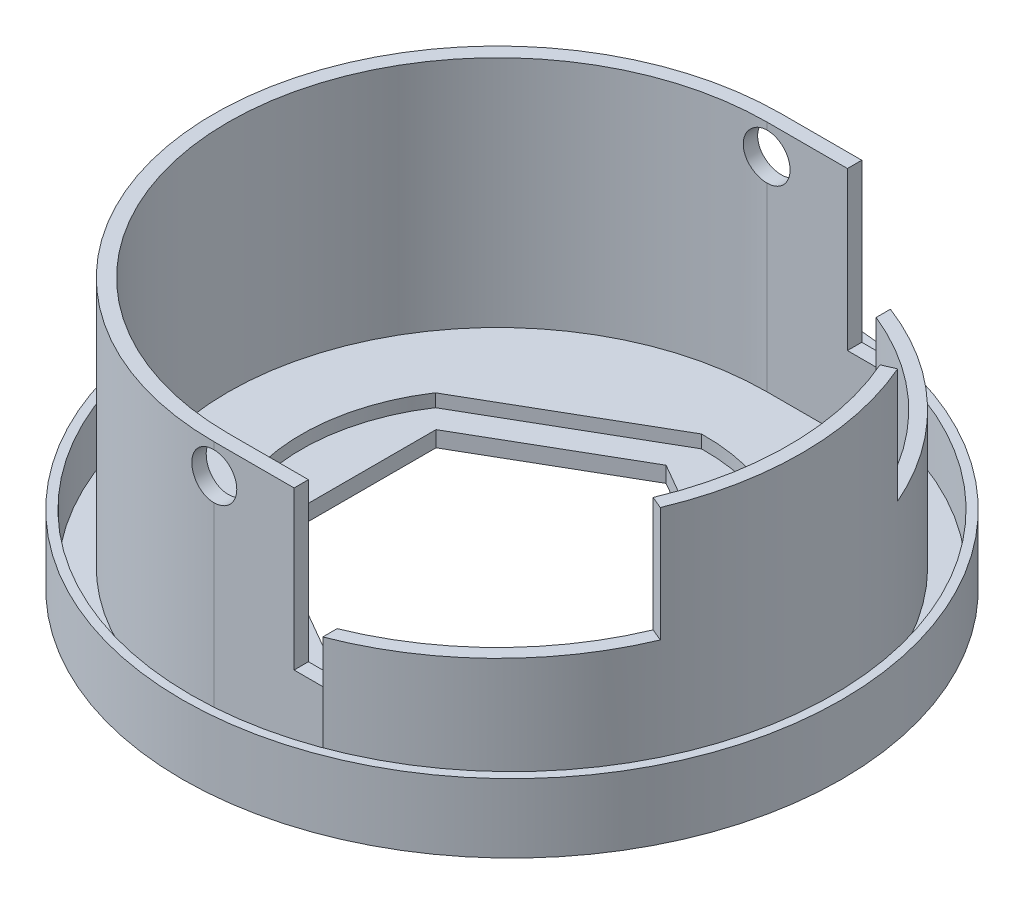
ISO-10303-21;
HEADER;
FILE_DESCRIPTION(('STEP AP214'),'2;1');
FILE_NAME('part.step','',(''),(''),'','','');
FILE_SCHEMA(('AUTOMOTIVE_DESIGN { 1 0 10303 214 1 1 1 1 }'));
ENDSEC;
DATA;
#1=APPLICATION_CONTEXT('core data for automotive mechanical design processes');
#2=APPLICATION_PROTOCOL_DEFINITION('international standard','automotive_design',2000,#1);
#3=PRODUCT_CONTEXT('',#1,'mechanical');
#4=PRODUCT('Part','Part','',(#3));
#5=PRODUCT_RELATED_PRODUCT_CATEGORY('part','',(#4));
#6=PRODUCT_DEFINITION_FORMATION('','',#4);
#7=PRODUCT_DEFINITION_CONTEXT('part definition',#1,'design');
#8=PRODUCT_DEFINITION('design','',#6,#7);
#9=PRODUCT_DEFINITION_SHAPE('','',#8);
#10=(LENGTH_UNIT() NAMED_UNIT(*) SI_UNIT(.MILLI.,.METRE.));
#11=(NAMED_UNIT(*) PLANE_ANGLE_UNIT() SI_UNIT($,.RADIAN.));
#12=(NAMED_UNIT(*) SI_UNIT($,.STERADIAN.) SOLID_ANGLE_UNIT());
#13=UNCERTAINTY_MEASURE_WITH_UNIT(LENGTH_MEASURE(1.E-05),#10,'distance_accuracy_value','');
#14=(GEOMETRIC_REPRESENTATION_CONTEXT(3) GLOBAL_UNCERTAINTY_ASSIGNED_CONTEXT((#13)) GLOBAL_UNIT_ASSIGNED_CONTEXT((#10,
#11,#12)) REPRESENTATION_CONTEXT('',''));
#15=CARTESIAN_POINT('',(0.,0.,0.));
#16=DIRECTION('',(0.,0.,1.));
#17=DIRECTION('',(1.,0.,0.));
#18=AXIS2_PLACEMENT_3D('',#15,#16,#17);
#19=CARTESIAN_POINT('',(0.,0.,0.));
#20=DIRECTION('',(0.,1.,0.));
#21=DIRECTION('',(0.,0.,1.));
#22=AXIS2_PLACEMENT_3D('',#19,#20,#21);
#23=PLANE('',#22);
#24=CARTESIAN_POINT('',(0.,0.,0.));
#25=DIRECTION('',(0.,-1.,0.));
#26=DIRECTION('',(0.,0.,-1.));
#27=AXIS2_PLACEMENT_3D('',#24,#25,#26);
#28=CIRCLE('',#27,15.);
#29=CARTESIAN_POINT('',(0.,0.,-15.));
#30=VERTEX_POINT('',#29);
#31=EDGE_CURVE('E621',#30,#30,#28,.T.);
#32=ORIENTED_EDGE('',*,*,#31,.F.);
#33=EDGE_LOOP('',(#32));
#34=FACE_BOUND('',#33,.T.);
#35=CARTESIAN_POINT('',(0.,0.,0.));
#36=DIRECTION('',(0.,-1.,0.));
#37=DIRECTION('',(0.,0.,-1.));
#38=AXIS2_PLACEMENT_3D('',#35,#36,#37);
#39=CIRCLE('',#38,16.5);
#40=CARTESIAN_POINT('',(0.,0.,-16.5));
#41=VERTEX_POINT('',#40);
#42=EDGE_CURVE('E884',#41,#41,#39,.T.);
#43=ORIENTED_EDGE('',*,*,#42,.T.);
#44=EDGE_LOOP('',(#43));
#45=FACE_BOUND('',#44,.T.);
#46=ADVANCED_FACE('F41',(#34,#45),#23,.F.);
#47=CARTESIAN_POINT('',(0.,-57.0073400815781,0.));
#48=DIRECTION('',(0.,1.,0.));
#49=DIRECTION('',(0.,0.,1.));
#50=AXIS2_PLACEMENT_3D('',#47,#48,#49);
#51=CYLINDRICAL_SURFACE('',#50,21.2082531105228);
#52=CARTESIAN_POINT('',(0.,18.3,0.));
#53=DIRECTION('',(0.,1.,0.));
#54=DIRECTION('',(0.,0.,1.));
#55=AXIS2_PLACEMENT_3D('',#52,#53,#54);
#56=CIRCLE('',#55,21.2082531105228);
#57=CARTESIAN_POINT('',(19.5542048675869,18.3,8.21115533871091));
#58=VERTEX_POINT('',#57);
#59=CARTESIAN_POINT('',(19.4538690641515,18.3,-8.44612209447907));
#60=VERTEX_POINT('',#59);
#61=EDGE_CURVE('E301',#58,#60,#56,.T.);
#62=ORIENTED_EDGE('',*,*,#61,.F.);
#63=DIRECTION('',(0.,1.,0.));
#64=VECTOR('',#63,1.);
#65=CARTESIAN_POINT('',(19.5542048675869,-57.0073400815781,8.21115533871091));
#66=LINE('',#65,#64);
#67=CARTESIAN_POINT('',(19.5542048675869,10.3,8.21115533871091));
#68=VERTEX_POINT('',#67);
#69=EDGE_CURVE('E268',#58,#68,#66,.F.);
#70=ORIENTED_EDGE('',*,*,#69,.T.);
#71=CARTESIAN_POINT('',(0.,10.3,0.));
#72=DIRECTION('',(0.,1.,0.));
#73=DIRECTION('',(0.,0.,1.));
#74=AXIS2_PLACEMENT_3D('',#71,#72,#73);
#75=CIRCLE('',#74,21.2082531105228);
#76=CARTESIAN_POINT('',(7.59934207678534,10.3,19.8));
#77=VERTEX_POINT('',#76);
#78=EDGE_CURVE('E596',#68,#77,#75,.F.);
#79=ORIENTED_EDGE('',*,*,#78,.T.);
#80=DIRECTION('',(0.,1.,0.));
#81=VECTOR('',#80,1.);
#82=CARTESIAN_POINT('',(7.59934207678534,7.3,19.8));
#83=LINE('',#82,#81);
#84=CARTESIAN_POINT('',(7.59934207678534,7.3,19.8));
#85=VERTEX_POINT('',#84);
#86=EDGE_CURVE('E565',#85,#77,#83,.T.);
#87=ORIENTED_EDGE('',*,*,#86,.F.);
#88=DIRECTION('',(0.,1.,0.));
#89=VECTOR('',#88,1.);
#90=CARTESIAN_POINT('',(7.59934207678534,-57.0073400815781,19.8));
#91=LINE('',#90,#89);
#92=CARTESIAN_POINT('',(7.59934207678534,0.800000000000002,19.8));
#93=VERTEX_POINT('',#92);
#94=EDGE_CURVE('E327',#93,#85,#91,.T.);
#95=ORIENTED_EDGE('',*,*,#94,.F.);
#96=CARTESIAN_POINT('',(0.,0.800000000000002,0.));
#97=DIRECTION('',(0.,-1.,0.));
#98=DIRECTION('',(0.,0.,-1.));
#99=AXIS2_PLACEMENT_3D('',#96,#97,#98);
#100=CIRCLE('',#99,21.2082531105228);
#101=CARTESIAN_POINT('',(7.59934207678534,0.800000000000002,-19.8));
#102=VERTEX_POINT('',#101);
#103=EDGE_CURVE('E442',#93,#102,#100,.F.);
#104=ORIENTED_EDGE('',*,*,#103,.T.);
#105=DIRECTION('',(0.,1.,0.));
#106=VECTOR('',#105,1.);
#107=CARTESIAN_POINT('',(7.59934207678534,-57.0073400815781,-19.8));
#108=LINE('',#107,#106);
#109=CARTESIAN_POINT('',(7.59934207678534,7.3,-19.8));
#110=VERTEX_POINT('',#109);
#111=EDGE_CURVE('E316',#102,#110,#108,.T.);
#112=ORIENTED_EDGE('',*,*,#111,.T.);
#113=DIRECTION('',(0.,1.,0.));
#114=VECTOR('',#113,1.);
#115=CARTESIAN_POINT('',(7.59934207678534,7.3,-19.8));
#116=LINE('',#115,#114);
#117=CARTESIAN_POINT('',(7.59934207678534,10.3,-19.8));
#118=VERTEX_POINT('',#117);
#119=EDGE_CURVE('E547',#110,#118,#116,.T.);
#120=ORIENTED_EDGE('',*,*,#119,.T.);
#121=CARTESIAN_POINT('',(0.,10.3,0.));
#122=DIRECTION('',(0.,1.,0.));
#123=DIRECTION('',(0.,0.,1.));
#124=AXIS2_PLACEMENT_3D('',#121,#122,#123);
#125=CIRCLE('',#124,21.2082531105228);
#126=CARTESIAN_POINT('',(19.4538690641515,10.3,-8.44612209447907));
#127=VERTEX_POINT('',#126);
#128=EDGE_CURVE('E64',#118,#127,#125,.F.);
#129=ORIENTED_EDGE('',*,*,#128,.T.);
#130=DIRECTION('',(0.,1.,0.));
#131=VECTOR('',#130,1.);
#132=CARTESIAN_POINT('',(19.4538690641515,-57.0073400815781,-8.44612209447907));
#133=LINE('',#132,#131);
#134=EDGE_CURVE('E608',#127,#60,#133,.T.);
#135=ORIENTED_EDGE('',*,*,#134,.T.);
#136=EDGE_LOOP('',(#62,#70,#79,#87,#95,#104,#112,#120,#129,#135));
#137=FACE_BOUND('',#136,.T.);
#138=ADVANCED_FACE('F595',(#137),#51,.T.);
#139=CARTESIAN_POINT('',(0.,18.3,0.));
#140=DIRECTION('',(0.,1.,0.));
#141=DIRECTION('',(0.,0.,1.));
#142=AXIS2_PLACEMENT_3D('',#139,#140,#141);
#143=PLANE('',#142);
#144=CARTESIAN_POINT('',(0.,18.3,0.));
#145=DIRECTION('',(0.,1.,0.));
#146=DIRECTION('',(0.,0.,-1.));
#147=AXIS2_PLACEMENT_3D('',#144,#145,#146);
#148=CIRCLE('',#147,20.2778203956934);
#149=CARTESIAN_POINT('',(18.6963373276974,18.3,7.85092163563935));
#150=VERTEX_POINT('',#149);
#151=CARTESIAN_POINT('',(18.6004033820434,18.3,-8.07558010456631));
#152=VERTEX_POINT('',#151);
#153=EDGE_CURVE('E277',#150,#152,#148,.T.);
#154=ORIENTED_EDGE('',*,*,#153,.F.);
#155=DIRECTION('',(0.922009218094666,0.,0.387167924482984));
#156=VECTOR('',#155,1.);
#157=CARTESIAN_POINT('',(0.,18.3,0.));
#158=LINE('',#157,#156);
#159=EDGE_CURVE('E263',#150,#58,#158,.T.);
#160=ORIENTED_EDGE('',*,*,#159,.T.);
#161=ORIENTED_EDGE('',*,*,#61,.T.);
#162=DIRECTION('',(-0.917278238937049,0.,0.398246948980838));
#163=VECTOR('',#162,1.);
#164=CARTESIAN_POINT('',(27.1211074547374,18.3,-11.7749422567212));
#165=LINE('',#164,#163);
#166=EDGE_CURVE('E284',#60,#152,#165,.T.);
#167=ORIENTED_EDGE('',*,*,#166,.T.);
#168=EDGE_LOOP('',(#154,#160,#161,#167));
#169=FACE_BOUND('',#168,.T.);
#170=ADVANCED_FACE('F282',(#169),#143,.T.);
#171=CARTESIAN_POINT('',(0.,-57.0073400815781,0.));
#172=DIRECTION('',(0.,1.,0.));
#173=DIRECTION('',(0.,0.,1.));
#174=AXIS2_PLACEMENT_3D('',#171,#172,#173);
#175=CYLINDRICAL_SURFACE('',#174,20.2778203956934);
#176=DIRECTION('',(0.,1.,0.));
#177=VECTOR('',#176,1.);
#178=CARTESIAN_POINT('',(18.6963373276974,-57.0073400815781,7.85092163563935));
#179=LINE('',#178,#177);
#180=CARTESIAN_POINT('',(18.6963373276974,10.3,7.85092163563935));
#181=VERTEX_POINT('',#180);
#182=EDGE_CURVE('E49',#150,#181,#179,.F.);
#183=ORIENTED_EDGE('',*,*,#182,.F.);
#184=ORIENTED_EDGE('',*,*,#153,.T.);
#185=DIRECTION('',(0.,1.,0.));
#186=VECTOR('',#185,1.);
#187=CARTESIAN_POINT('',(18.6004033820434,-57.0073400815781,-8.07558010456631));
#188=LINE('',#187,#186);
#189=CARTESIAN_POINT('',(18.6004033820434,10.3,-8.07558010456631));
#190=VERTEX_POINT('',#189);
#191=EDGE_CURVE('E635',#190,#152,#188,.T.);
#192=ORIENTED_EDGE('',*,*,#191,.F.);
#193=CARTESIAN_POINT('',(0.,10.3,0.));
#194=DIRECTION('',(0.,1.,0.));
#195=DIRECTION('',(0.,0.,1.));
#196=AXIS2_PLACEMENT_3D('',#193,#194,#195);
#197=CIRCLE('',#196,20.2778203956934);
#198=CARTESIAN_POINT('',(7.59934207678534,10.3,-18.8));
#199=VERTEX_POINT('',#198);
#200=EDGE_CURVE('E532',#199,#190,#197,.F.);
#201=ORIENTED_EDGE('',*,*,#200,.F.);
#202=DIRECTION('',(0.,1.,0.));
#203=VECTOR('',#202,1.);
#204=CARTESIAN_POINT('',(7.59934207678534,-57.0073400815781,-18.8));
#205=LINE('',#204,#203);
#206=CARTESIAN_POINT('',(7.59934207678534,7.3,-18.8));
#207=VERTEX_POINT('',#206);
#208=EDGE_CURVE('E531',#199,#207,#205,.F.);
#209=ORIENTED_EDGE('',*,*,#208,.T.);
#210=DIRECTION('',(0.,1.,0.));
#211=VECTOR('',#210,1.);
#212=CARTESIAN_POINT('',(7.59934207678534,-57.0073400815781,-18.8));
#213=LINE('',#212,#211);
#214=CARTESIAN_POINT('',(7.59934207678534,2.,-18.8));
#215=VERTEX_POINT('',#214);
#216=EDGE_CURVE('E312',#215,#207,#213,.T.);
#217=ORIENTED_EDGE('',*,*,#216,.F.);
#218=CARTESIAN_POINT('',(0.,2.,0.));
#219=DIRECTION('',(0.,1.,0.));
#220=DIRECTION('',(0.,0.,-1.));
#221=AXIS2_PLACEMENT_3D('',#218,#219,#220);
#222=CIRCLE('',#221,20.2778203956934);
#223=CARTESIAN_POINT('',(7.59934207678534,2.,18.8));
#224=VERTEX_POINT('',#223);
#225=EDGE_CURVE('E329',#224,#215,#222,.T.);
#226=ORIENTED_EDGE('',*,*,#225,.F.);
#227=DIRECTION('',(0.,1.,0.));
#228=VECTOR('',#227,1.);
#229=CARTESIAN_POINT('',(7.59934207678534,-57.0073400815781,18.8));
#230=LINE('',#229,#228);
#231=CARTESIAN_POINT('',(7.59934207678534,7.3,18.8));
#232=VERTEX_POINT('',#231);
#233=EDGE_CURVE('E313',#224,#232,#230,.T.);
#234=ORIENTED_EDGE('',*,*,#233,.T.);
#235=DIRECTION('',(0.,1.,0.));
#236=VECTOR('',#235,1.);
#237=CARTESIAN_POINT('',(7.59934207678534,-57.0073400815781,18.8));
#238=LINE('',#237,#236);
#239=CARTESIAN_POINT('',(7.59934207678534,10.3,18.8));
#240=VERTEX_POINT('',#239);
#241=EDGE_CURVE('E535',#232,#240,#238,.T.);
#242=ORIENTED_EDGE('',*,*,#241,.T.);
#243=CARTESIAN_POINT('',(0.,10.3,0.));
#244=DIRECTION('',(0.,1.,0.));
#245=DIRECTION('',(0.,0.,1.));
#246=AXIS2_PLACEMENT_3D('',#243,#244,#245);
#247=CIRCLE('',#246,20.2778203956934);
#248=EDGE_CURVE('E56',#181,#240,#247,.F.);
#249=ORIENTED_EDGE('',*,*,#248,.F.);
#250=EDGE_LOOP('',(#183,#184,#192,#201,#209,#217,#226,#234,#242,#249));
#251=FACE_BOUND('',#250,.T.);
#252=ADVANCED_FACE('F275',(#251),#175,.F.);
#253=CARTESIAN_POINT('',(7.59934207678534,7.3,-19.8));
#254=DIRECTION('',(1.,0.,0.));
#255=DIRECTION('',(0.,0.,-1.));
#256=AXIS2_PLACEMENT_3D('',#253,#254,#255);
#257=PLANE('',#256);
#258=DIRECTION('',(0.,0.,1.));
#259=VECTOR('',#258,1.);
#260=CARTESIAN_POINT('',(7.59934207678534,10.3,-19.8));
#261=LINE('',#260,#259);
#262=EDGE_CURVE('E280',#240,#77,#261,.T.);
#263=ORIENTED_EDGE('',*,*,#262,.F.);
#264=ORIENTED_EDGE('',*,*,#241,.F.);
#265=DIRECTION('',(0.,0.,-1.));
#266=VECTOR('',#265,1.);
#267=CARTESIAN_POINT('',(7.59934207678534,7.3,-19.8));
#268=LINE('',#267,#266);
#269=EDGE_CURVE('E549',#85,#232,#268,.T.);
#270=ORIENTED_EDGE('',*,*,#269,.F.);
#271=ORIENTED_EDGE('',*,*,#86,.T.);
#272=EDGE_LOOP('',(#263,#264,#270,#271));
#273=FACE_BOUND('',#272,.T.);
#274=ADVANCED_FACE('F586',(#273),#257,.F.);
#275=DIRECTION('',(0.,0.,1.));
#276=VECTOR('',#275,1.);
#277=CARTESIAN_POINT('',(7.59934207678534,10.3,-19.8));
#278=LINE('',#277,#276);
#279=EDGE_CURVE('E634',#118,#199,#278,.T.);
#280=ORIENTED_EDGE('',*,*,#279,.F.);
#281=ORIENTED_EDGE('',*,*,#119,.F.);
#282=EDGE_CURVE('E542',#207,#110,#268,.T.);
#283=ORIENTED_EDGE('',*,*,#282,.F.);
#284=ORIENTED_EDGE('',*,*,#208,.F.);
#285=EDGE_LOOP('',(#280,#281,#283,#284));
#286=FACE_BOUND('',#285,.T.);
#287=ADVANCED_FACE('F545',(#286),#257,.F.);
#288=DIRECTION('',(0.,0.,1.));
#289=VECTOR('',#288,1.);
#290=CARTESIAN_POINT('',(10.175,0.,-5.87453898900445));
#291=LINE('',#290,#289);
#292=CARTESIAN_POINT('',(10.175,0.,-5.87453898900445));
#293=VERTEX_POINT('',#292);
#294=CARTESIAN_POINT('',(10.175,0.,5.87453898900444));
#295=VERTEX_POINT('',#294);
#296=EDGE_CURVE('E419',#293,#295,#291,.T.);
#297=ORIENTED_EDGE('',*,*,#296,.F.);
#298=DIRECTION('',(0.866025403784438,0.,0.5));
#299=VECTOR('',#298,1.);
#300=CARTESIAN_POINT('',(0.,0.,-11.7490779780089));
#301=LINE('',#300,#299);
#302=CARTESIAN_POINT('',(0.,0.,-11.7490779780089));
#303=VERTEX_POINT('',#302);
#304=EDGE_CURVE('E422',#303,#293,#301,.T.);
#305=ORIENTED_EDGE('',*,*,#304,.F.);
#306=DIRECTION('',(0.866025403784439,0.,-0.5));
#307=VECTOR('',#306,1.);
#308=CARTESIAN_POINT('',(-10.175,0.,-5.87453898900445));
#309=LINE('',#308,#307);
#310=CARTESIAN_POINT('',(-10.175,0.,-5.87453898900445));
#311=VERTEX_POINT('',#310);
#312=EDGE_CURVE('E408',#311,#303,#309,.T.);
#313=ORIENTED_EDGE('',*,*,#312,.F.);
#314=DIRECTION('',(0.,0.,-1.));
#315=VECTOR('',#314,1.);
#316=CARTESIAN_POINT('',(-10.175,0.,5.87453898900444));
#317=LINE('',#316,#315);
#318=CARTESIAN_POINT('',(-10.175,0.,5.87453898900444));
#319=VERTEX_POINT('',#318);
#320=EDGE_CURVE('E409',#319,#311,#317,.T.);
#321=ORIENTED_EDGE('',*,*,#320,.F.);
#322=DIRECTION('',(-0.866025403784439,0.,-0.5));
#323=VECTOR('',#322,1.);
#324=CARTESIAN_POINT('',(0.,0.,11.7490779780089));
#325=LINE('',#324,#323);
#326=CARTESIAN_POINT('',(0.,0.,11.7490779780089));
#327=VERTEX_POINT('',#326);
#328=EDGE_CURVE('E413',#327,#319,#325,.T.);
#329=ORIENTED_EDGE('',*,*,#328,.F.);
#330=DIRECTION('',(-0.866025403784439,0.,0.5));
#331=VECTOR('',#330,1.);
#332=CARTESIAN_POINT('',(10.175,0.,5.87453898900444));
#333=LINE('',#332,#331);
#334=EDGE_CURVE('E416',#295,#327,#333,.T.);
#335=ORIENTED_EDGE('',*,*,#334,.F.);
#336=EDGE_LOOP('',(#297,#305,#313,#321,#329,#335));
#337=FACE_BOUND('',#336,.T.);
#338=CARTESIAN_POINT('',(0.,0.,0.));
#339=DIRECTION('',(0.,-1.,0.));
#340=DIRECTION('',(0.,0.,-1.));
#341=AXIS2_PLACEMENT_3D('',#338,#339,#340);
#342=CIRCLE('',#341,14.);
#343=CARTESIAN_POINT('',(0.,0.,-14.));
#344=VERTEX_POINT('',#343);
#345=EDGE_CURVE('E615',#344,#344,#342,.T.);
#346=ORIENTED_EDGE('',*,*,#345,.T.);
#347=EDGE_LOOP('',(#346));
#348=FACE_BOUND('',#347,.T.);
#349=ADVANCED_FACE('F654',(#337,#348),#23,.F.);
#350=CARTESIAN_POINT('',(1.,0.8,0.));
#351=DIRECTION('',(0.,-1.,0.));
#352=DIRECTION('',(0.,0.,-1.));
#353=AXIS2_PLACEMENT_3D('',#350,#351,#352);
#354=PLANE('',#353);
#355=DIRECTION('',(-1.,0.,0.));
#356=VECTOR('',#355,1.);
#357=CARTESIAN_POINT('',(7.59934207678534,0.800000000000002,-19.8));
#358=LINE('',#357,#356);
#359=CARTESIAN_POINT('',(0.,0.800000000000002,-19.8));
#360=VERTEX_POINT('',#359);
#361=EDGE_CURVE('E554',#102,#360,#358,.T.);
#362=ORIENTED_EDGE('',*,*,#361,.F.);
#363=ORIENTED_EDGE('',*,*,#103,.F.);
#364=DIRECTION('',(1.,0.,0.));
#365=VECTOR('',#364,1.);
#366=CARTESIAN_POINT('',(0.,0.800000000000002,19.8));
#367=LINE('',#366,#365);
#368=CARTESIAN_POINT('',(0.,0.800000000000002,19.8));
#369=VERTEX_POINT('',#368);
#370=EDGE_CURVE('E683',#369,#93,#367,.T.);
#371=ORIENTED_EDGE('',*,*,#370,.F.);
#372=CARTESIAN_POINT('',(0.,0.800000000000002,0.));
#373=DIRECTION('',(0.,-1.,0.));
#374=DIRECTION('',(0.,0.,-1.));
#375=AXIS2_PLACEMENT_3D('',#372,#373,#374);
#376=CIRCLE('',#375,19.8);
#377=EDGE_CURVE('E687',#360,#369,#376,.F.);
#378=ORIENTED_EDGE('',*,*,#377,.F.);
#379=EDGE_LOOP('',(#362,#363,#371,#378));
#380=FACE_BOUND('',#379,.T.);
#381=CARTESIAN_POINT('',(1.,0.8,0.));
#382=DIRECTION('',(0.,1.,0.));
#383=DIRECTION('',(0.,0.,1.));
#384=AXIS2_PLACEMENT_3D('',#381,#382,#383);
#385=CIRCLE('',#384,22.4);
#386=CARTESIAN_POINT('',(1.,0.8,22.4));
#387=VERTEX_POINT('',#386);
#388=EDGE_CURVE('E481',#387,#387,#385,.T.);
#389=ORIENTED_EDGE('',*,*,#388,.T.);
#390=EDGE_LOOP('',(#389));
#391=FACE_BOUND('',#390,.T.);
#392=ADVANCED_FACE('F661',(#380,#391),#354,.F.);
#393=CARTESIAN_POINT('',(7.59934207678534,-57.0073400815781,-19.8));
#394=DIRECTION('',(0.,0.,-1.));
#395=DIRECTION('',(-1.,0.,0.));
#396=AXIS2_PLACEMENT_3D('',#393,#394,#395);
#397=PLANE('',#396);
#398=CARTESIAN_POINT('',(0.,16.2125,-19.8));
#399=DIRECTION('',(0.,0.,-1.));
#400=DIRECTION('',(-1.,0.,0.));
#401=AXIS2_PLACEMENT_3D('',#398,#399,#400);
#402=CIRCLE('',#401,1.6);
#403=CARTESIAN_POINT('',(0.,17.8125,-19.8));
#404=VERTEX_POINT('',#403);
#405=CARTESIAN_POINT('',(0.,14.6125,-19.8));
#406=VERTEX_POINT('',#405);
#407=EDGE_CURVE('E504',#404,#406,#402,.T.);
#408=ORIENTED_EDGE('',*,*,#407,.F.);
#409=DIRECTION('',(0.,1.,0.));
#410=VECTOR('',#409,1.);
#411=CARTESIAN_POINT('',(0.,-57.0073400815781,-19.8));
#412=LINE('',#411,#410);
#413=CARTESIAN_POINT('',(0.,18.3,-19.8));
#414=VERTEX_POINT('',#413);
#415=EDGE_CURVE('E337',#404,#414,#412,.T.);
#416=ORIENTED_EDGE('',*,*,#415,.T.);
#417=DIRECTION('',(-1.,0.,0.));
#418=VECTOR('',#417,1.);
#419=CARTESIAN_POINT('',(7.59934207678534,18.3,-19.8));
#420=LINE('',#419,#418);
#421=CARTESIAN_POINT('',(5.59934207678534,18.3,-19.8));
#422=VERTEX_POINT('',#421);
#423=EDGE_CURVE('E303',#422,#414,#420,.T.);
#424=ORIENTED_EDGE('',*,*,#423,.F.);
#425=DIRECTION('',(0.,1.,0.));
#426=VECTOR('',#425,1.);
#427=CARTESIAN_POINT('',(5.59934207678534,7.3,-19.8));
#428=LINE('',#427,#426);
#429=CARTESIAN_POINT('',(5.59934207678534,7.3,-19.8));
#430=VERTEX_POINT('',#429);
#431=EDGE_CURVE('E572',#430,#422,#428,.T.);
#432=ORIENTED_EDGE('',*,*,#431,.F.);
#433=DIRECTION('',(-1.,0.,0.));
#434=VECTOR('',#433,1.);
#435=CARTESIAN_POINT('',(7.59934207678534,7.3,-19.8));
#436=LINE('',#435,#434);
#437=EDGE_CURVE('E553',#110,#430,#436,.T.);
#438=ORIENTED_EDGE('',*,*,#437,.F.);
#439=ORIENTED_EDGE('',*,*,#111,.F.);
#440=ORIENTED_EDGE('',*,*,#361,.T.);
#441=EDGE_CURVE('E334',#360,#406,#412,.T.);
#442=ORIENTED_EDGE('',*,*,#441,.T.);
#443=EDGE_LOOP('',(#408,#416,#424,#432,#438,#439,#440,#442));
#444=FACE_BOUND('',#443,.T.);
#445=ADVANCED_FACE('F492',(#444),#397,.T.);
#446=CARTESIAN_POINT('',(0.,-57.0073400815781,0.));
#447=DIRECTION('',(0.,1.,0.));
#448=DIRECTION('',(0.,0.,1.));
#449=AXIS2_PLACEMENT_3D('',#446,#447,#448);
#450=CYLINDRICAL_SURFACE('',#449,19.8);
#451=CARTESIAN_POINT('',(0.,17.8125,19.8));
#452=CARTESIAN_POINT('',(-0.0449365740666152,17.8124997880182,19.800000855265));
#453=CARTESIAN_POINT('',(-0.0898515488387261,17.8106057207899,19.799846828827));
#454=CARTESIAN_POINT('',(-0.179358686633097,17.8030500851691,19.7992380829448));
#455=CARTESIAN_POINT('',(-0.223950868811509,17.7973887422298,19.7987833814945));
#456=CARTESIAN_POINT('',(-0.3566787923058,17.7748098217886,19.7969839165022));
#457=CARTESIAN_POINT('',(-0.44392318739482,17.7522971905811,19.7952037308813));
#458=CARTESIAN_POINT('',(-0.613375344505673,17.6929875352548,19.7906791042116));
#459=CARTESIAN_POINT('',(-0.695581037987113,17.6561846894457,19.7879342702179));
#460=CARTESIAN_POINT('',(-0.852648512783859,17.5693483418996,19.7817888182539));
#461=CARTESIAN_POINT('',(-0.927511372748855,17.5193167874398,19.7783882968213));
#462=CARTESIAN_POINT('',(-1.06793655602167,17.4073201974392,19.7713043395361));
#463=CARTESIAN_POINT('',(-1.13347956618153,17.345330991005,19.7676203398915));
#464=CARTESIAN_POINT('',(-1.25325144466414,17.2112212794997,19.7603889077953));
#465=CARTESIAN_POINT('',(-1.30747858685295,17.1390992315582,19.7568414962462));
#466=CARTESIAN_POINT('',(-1.40313531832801,16.9866571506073,19.7502790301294));
#467=CARTESIAN_POINT('',(-1.44454760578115,16.9063262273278,19.7472646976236));
#468=CARTESIAN_POINT('',(-1.51328655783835,16.73982775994,19.7421163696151));
#469=CARTESIAN_POINT('',(-1.54061431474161,16.6536606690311,19.7399823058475));
#470=CARTESIAN_POINT('',(-1.58035441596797,16.4781308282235,19.7368406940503));
#471=CARTESIAN_POINT('',(-1.59279919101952,16.3887754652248,19.7358306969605));
#472=CARTESIAN_POINT('',(-1.60252032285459,16.209236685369,19.7350437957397));
#473=CARTESIAN_POINT('',(-1.59979657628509,16.1190532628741,19.7352669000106));
#474=CARTESIAN_POINT('',(-1.57928426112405,15.9406453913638,19.7369188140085));
#475=CARTESIAN_POINT('',(-1.56153136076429,15.8524168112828,19.738344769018));
#476=CARTESIAN_POINT('',(-1.51152014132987,15.680196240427,19.7422372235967));
#477=CARTESIAN_POINT('',(-1.47926175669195,15.5962042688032,19.7447037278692));
#478=CARTESIAN_POINT('',(-1.40111454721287,15.4347253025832,19.7504027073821));
#479=CARTESIAN_POINT('',(-1.35520941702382,15.3572462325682,19.7536360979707));
#480=CARTESIAN_POINT('',(-1.25108565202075,15.211083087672,19.7605034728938));
#481=CARTESIAN_POINT('',(-1.1928673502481,15.1423987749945,19.7641374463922));
#482=CARTESIAN_POINT('',(-1.06557912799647,15.0155724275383,19.7714088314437));
#483=CARTESIAN_POINT('',(-0.996479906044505,14.9574597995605,19.7750462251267));
#484=CARTESIAN_POINT('',(-0.849463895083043,14.8536367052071,19.7819062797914));
#485=CARTESIAN_POINT('',(-0.771544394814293,14.8079300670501,19.7851288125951));
#486=CARTESIAN_POINT('',(-0.609070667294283,14.7302200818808,19.7907969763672));
#487=CARTESIAN_POINT('',(-0.524511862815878,14.6982262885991,19.7932420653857));
#488=CARTESIAN_POINT('',(-0.351262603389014,14.6489466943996,19.7970726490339));
#489=CARTESIAN_POINT('',(-0.262578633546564,14.6316385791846,19.7984597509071));
#490=CARTESIAN_POINT('',(-0.144403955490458,14.6187651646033,19.7994946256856));
#491=CARTESIAN_POINT('',(-0.115548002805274,14.616414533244,19.7996840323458));
#492=CARTESIAN_POINT('',(-0.0577986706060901,14.6132840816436,19.7999365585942));
#493=CARTESIAN_POINT('',(-0.0289054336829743,14.612501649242,19.7999998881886));
#494=CARTESIAN_POINT('',(0.,14.6125,19.8));
#495=B_SPLINE_CURVE_WITH_KNOTS('',3,(#451,#452,#453,#454,#455,#456,#457,#458,#459,#460,#461,
#462,#463,#464,#465,#466,#467,#468,#469,#470,#471,#472,#473,#474,#475,#476,#477,#478,#479,#480,
#481,#482,#483,#484,#485,#486,#487,#488,#489,#490,#491,#492,#493,#494),.UNSPECIFIED.,.F.,.F.,(4,
2,2,2,2,2,2,2,2,2,2,2,2,2,2,2,2,2,2,2,2,4),(0.,0.134726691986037,0.26944532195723,
0.538416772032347,0.807497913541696,1.07653946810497,1.34613066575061,1.6157629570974,
1.8857577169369,2.15573153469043,2.42511598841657,2.69450227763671,2.96325102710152,
3.23200099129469,3.5010733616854,3.77013845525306,4.03994091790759,4.30982654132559,
4.57989988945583,4.84956213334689,4.93638814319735,5.02306940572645),.UNSPECIFIED.);
#496=CARTESIAN_POINT('',(0.,17.8125,19.8));
#497=VERTEX_POINT('',#496);
#498=CARTESIAN_POINT('',(0.,14.6125,19.8));
#499=VERTEX_POINT('',#498);
#500=EDGE_CURVE('E498',#497,#499,#495,.T.);
#501=ORIENTED_EDGE('',*,*,#500,.F.);
#502=DIRECTION('',(0.,1.,0.));
#503=VECTOR('',#502,1.);
#504=CARTESIAN_POINT('',(0.,-57.0073400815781,19.8));
#505=LINE('',#504,#503);
#506=CARTESIAN_POINT('',(0.,18.3,19.8));
#507=VERTEX_POINT('',#506);
#508=EDGE_CURVE('E333',#497,#507,#505,.T.);
#509=ORIENTED_EDGE('',*,*,#508,.T.);
#510=CARTESIAN_POINT('',(0.,18.3,0.));
#511=DIRECTION('',(0.,1.,0.));
#512=DIRECTION('',(0.,0.,1.));
#513=AXIS2_PLACEMENT_3D('',#510,#511,#512);
#514=CIRCLE('',#513,19.8);
#515=EDGE_CURVE('E306',#414,#507,#514,.T.);
#516=ORIENTED_EDGE('',*,*,#515,.F.);
#517=ORIENTED_EDGE('',*,*,#415,.F.);
#518=CARTESIAN_POINT('',(0.,14.6125,-19.8));
#519=CARTESIAN_POINT('',(-0.0449365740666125,14.6125002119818,-19.800000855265));
#520=CARTESIAN_POINT('',(-0.0898515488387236,14.6143942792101,-19.799846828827));
#521=CARTESIAN_POINT('',(-0.179358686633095,14.6219499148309,-19.7992380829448));
#522=CARTESIAN_POINT('',(-0.223950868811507,14.6276112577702,-19.7987833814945));
#523=CARTESIAN_POINT('',(-0.356678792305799,14.6501901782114,-19.7969839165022));
#524=CARTESIAN_POINT('',(-0.443923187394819,14.6727028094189,-19.7952037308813));
#525=CARTESIAN_POINT('',(-0.613375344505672,14.7320124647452,-19.7906791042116));
#526=CARTESIAN_POINT('',(-0.695581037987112,14.7688153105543,-19.7879342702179));
#527=CARTESIAN_POINT('',(-0.85264851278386,14.8556516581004,-19.7817888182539));
#528=CARTESIAN_POINT('',(-0.927511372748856,14.9056832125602,-19.7783882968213));
#529=CARTESIAN_POINT('',(-1.06793655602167,15.0176798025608,-19.7713043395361));
#530=CARTESIAN_POINT('',(-1.13347956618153,15.079669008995,-19.7676203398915));
#531=CARTESIAN_POINT('',(-1.25325144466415,15.2137787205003,-19.7603889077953));
#532=CARTESIAN_POINT('',(-1.30747858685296,15.2859007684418,-19.7568414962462));
#533=CARTESIAN_POINT('',(-1.40313531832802,15.4383428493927,-19.7502790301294));
#534=CARTESIAN_POINT('',(-1.44454760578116,15.5186737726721,-19.7472646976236));
#535=CARTESIAN_POINT('',(-1.51328655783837,15.68517224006,-19.7421163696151));
#536=CARTESIAN_POINT('',(-1.54061431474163,15.7713393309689,-19.7399823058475));
#537=CARTESIAN_POINT('',(-1.58035441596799,15.9468691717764,-19.7368406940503));
#538=CARTESIAN_POINT('',(-1.59279919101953,16.0362245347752,-19.7358306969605));
#539=CARTESIAN_POINT('',(-1.60252032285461,16.215763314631,-19.7350437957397));
#540=CARTESIAN_POINT('',(-1.59979657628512,16.3059467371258,-19.7352669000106));
#541=CARTESIAN_POINT('',(-1.57928426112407,16.4843546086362,-19.7369188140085));
#542=CARTESIAN_POINT('',(-1.56153136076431,16.5725831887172,-19.738344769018));
#543=CARTESIAN_POINT('',(-1.5115201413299,16.7448037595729,-19.7422372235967));
#544=CARTESIAN_POINT('',(-1.47926175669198,16.8287957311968,-19.7447037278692));
#545=CARTESIAN_POINT('',(-1.4011145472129,16.9902746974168,-19.7504027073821));
#546=CARTESIAN_POINT('',(-1.35520941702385,17.0677537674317,-19.7536360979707));
#547=CARTESIAN_POINT('',(-1.25108565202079,17.213916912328,-19.7605034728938));
#548=CARTESIAN_POINT('',(-1.19286735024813,17.2826012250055,-19.7641374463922));
#549=CARTESIAN_POINT('',(-1.0655791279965,17.4094275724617,-19.7714088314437));
#550=CARTESIAN_POINT('',(-0.996479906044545,17.4675402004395,-19.7750462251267));
#551=CARTESIAN_POINT('',(-0.849463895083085,17.5713632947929,-19.7819062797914));
#552=CARTESIAN_POINT('',(-0.771544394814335,17.6170699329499,-19.7851288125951));
#553=CARTESIAN_POINT('',(-0.609070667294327,17.6947799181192,-19.7907969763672));
#554=CARTESIAN_POINT('',(-0.524511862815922,17.7267737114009,-19.7932420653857));
#555=CARTESIAN_POINT('',(-0.351262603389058,17.7760533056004,-19.7970726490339));
#556=CARTESIAN_POINT('',(-0.262578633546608,17.7933614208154,-19.7984597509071));
#557=CARTESIAN_POINT('',(-0.144403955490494,17.8062348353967,-19.7994946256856));
#558=CARTESIAN_POINT('',(-0.115548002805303,17.808585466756,-19.7996840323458));
#559=CARTESIAN_POINT('',(-0.0577986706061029,17.8117159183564,-19.7999365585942));
#560=CARTESIAN_POINT('',(-0.0289054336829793,17.8124983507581,-19.7999998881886));
#561=CARTESIAN_POINT('',(0.,17.8125,-19.8));
#562=B_SPLINE_CURVE_WITH_KNOTS('',3,(#518,#519,#520,#521,#522,#523,#524,#525,#526,#527,#528,
#529,#530,#531,#532,#533,#534,#535,#536,#537,#538,#539,#540,#541,#542,#543,#544,#545,#546,#547,
#548,#549,#550,#551,#552,#553,#554,#555,#556,#557,#558,#559,#560,#561),.UNSPECIFIED.,.F.,.F.,(4,
2,2,2,2,2,2,2,2,2,2,2,2,2,2,2,2,2,2,2,2,4),(0.,0.134726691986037,0.269445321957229,
0.538416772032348,0.807497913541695,1.07653946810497,1.3461306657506,1.6157629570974,
1.8857577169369,2.15573153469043,2.42511598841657,2.69450227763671,2.96325102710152,
3.23200099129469,3.5010733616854,3.77013845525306,4.03994091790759,4.30982654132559,
4.57989988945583,4.84956213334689,4.93638814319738,5.0230694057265),.UNSPECIFIED.);
#563=EDGE_CURVE('E473',#406,#404,#562,.T.);
#564=ORIENTED_EDGE('',*,*,#563,.F.);
#565=ORIENTED_EDGE('',*,*,#441,.F.);
#566=ORIENTED_EDGE('',*,*,#377,.T.);
#567=EDGE_CURVE('E330',#369,#499,#505,.T.);
#568=ORIENTED_EDGE('',*,*,#567,.T.);
#569=EDGE_LOOP('',(#501,#509,#516,#517,#564,#565,#566,#568));
#570=FACE_BOUND('',#569,.T.);
#571=ADVANCED_FACE('F486',(#570),#450,.T.);
#572=CARTESIAN_POINT('',(0.,-57.0073400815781,19.8));
#573=DIRECTION('',(0.,0.,1.));
#574=DIRECTION('',(1.,0.,0.));
#575=AXIS2_PLACEMENT_3D('',#572,#573,#574);
#576=PLANE('',#575);
#577=CARTESIAN_POINT('',(0.,16.2125,19.8));
#578=DIRECTION('',(0.,0.,1.));
#579=DIRECTION('',(1.,0.,0.));
#580=AXIS2_PLACEMENT_3D('',#577,#578,#579);
#581=CIRCLE('',#580,1.6);
#582=EDGE_CURVE('E627',#499,#497,#581,.T.);
#583=ORIENTED_EDGE('',*,*,#582,.F.);
#584=ORIENTED_EDGE('',*,*,#567,.F.);
#585=ORIENTED_EDGE('',*,*,#370,.T.);
#586=ORIENTED_EDGE('',*,*,#94,.T.);
#587=DIRECTION('',(1.,0.,0.));
#588=VECTOR('',#587,1.);
#589=CARTESIAN_POINT('',(7.59934207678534,7.3,19.8));
#590=LINE('',#589,#588);
#591=CARTESIAN_POINT('',(5.59934207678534,7.3,19.8));
#592=VERTEX_POINT('',#591);
#593=EDGE_CURVE('E562',#592,#85,#590,.T.);
#594=ORIENTED_EDGE('',*,*,#593,.F.);
#595=DIRECTION('',(0.,1.,0.));
#596=VECTOR('',#595,1.);
#597=CARTESIAN_POINT('',(5.59934207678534,7.3,19.8));
#598=LINE('',#597,#596);
#599=CARTESIAN_POINT('',(5.59934207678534,18.3,19.8));
#600=VERTEX_POINT('',#599);
#601=EDGE_CURVE('E569',#592,#600,#598,.T.);
#602=ORIENTED_EDGE('',*,*,#601,.T.);
#603=DIRECTION('',(1.,0.,0.));
#604=VECTOR('',#603,1.);
#605=CARTESIAN_POINT('',(0.,18.3,19.8));
#606=LINE('',#605,#604);
#607=EDGE_CURVE('E309',#507,#600,#606,.T.);
#608=ORIENTED_EDGE('',*,*,#607,.F.);
#609=ORIENTED_EDGE('',*,*,#508,.F.);
#610=EDGE_LOOP('',(#583,#584,#585,#586,#594,#602,#608,#609));
#611=FACE_BOUND('',#610,.T.);
#612=ADVANCED_FACE('F491',(#611),#576,.T.);
#613=CARTESIAN_POINT('',(0.,33.0851384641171,-11.7490779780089));
#614=DIRECTION('',(0.5,0.,-0.866025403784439));
#615=DIRECTION('',(-0.866025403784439,0.,-0.5));
#616=AXIS2_PLACEMENT_3D('',#613,#614,#615);
#617=PLANE('',#616);
#618=DIRECTION('',(0.866025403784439,0.,0.5));
#619=VECTOR('',#618,1.);
#620=CARTESIAN_POINT('',(0.,1.1,-11.7490779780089));
#621=LINE('',#620,#619);
#622=CARTESIAN_POINT('',(0.,1.1,-11.7490779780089));
#623=VERTEX_POINT('',#622);
#624=CARTESIAN_POINT('',(10.175,1.1,-5.87453898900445));
#625=VERTEX_POINT('',#624);
#626=EDGE_CURVE('E406',#623,#625,#621,.T.);
#627=ORIENTED_EDGE('',*,*,#626,.F.);
#628=DIRECTION('',(0.,-1.,0.));
#629=VECTOR('',#628,1.);
#630=CARTESIAN_POINT('',(0.,33.0851384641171,-11.7490779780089));
#631=LINE('',#630,#629);
#632=EDGE_CURVE('E429',#623,#303,#631,.T.);
#633=ORIENTED_EDGE('',*,*,#632,.T.);
#634=ORIENTED_EDGE('',*,*,#304,.T.);
#635=DIRECTION('',(0.,-1.,0.));
#636=VECTOR('',#635,1.);
#637=CARTESIAN_POINT('',(10.175,33.0851384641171,-5.87453898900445));
#638=LINE('',#637,#636);
#639=EDGE_CURVE('E412',#625,#293,#638,.T.);
#640=ORIENTED_EDGE('',*,*,#639,.F.);
#641=EDGE_LOOP('',(#627,#633,#634,#640));
#642=FACE_BOUND('',#641,.T.);
#643=ADVANCED_FACE('F1037',(#642),#617,.F.);
#644=CARTESIAN_POINT('',(10.175,33.0851384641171,-5.87453898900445));
#645=DIRECTION('',(1.,0.,0.));
#646=DIRECTION('',(0.,0.,-1.));
#647=AXIS2_PLACEMENT_3D('',#644,#645,#646);
#648=PLANE('',#647);
#649=DIRECTION('',(0.,0.,1.));
#650=VECTOR('',#649,1.);
#651=CARTESIAN_POINT('',(10.175,1.1,-5.87453898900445));
#652=LINE('',#651,#650);
#653=CARTESIAN_POINT('',(10.175,1.1,5.87453898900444));
#654=VERTEX_POINT('',#653);
#655=EDGE_CURVE('E404',#625,#654,#652,.T.);
#656=ORIENTED_EDGE('',*,*,#655,.F.);
#657=ORIENTED_EDGE('',*,*,#639,.T.);
#658=ORIENTED_EDGE('',*,*,#296,.T.);
#659=DIRECTION('',(0.,-1.,0.));
#660=VECTOR('',#659,1.);
#661=CARTESIAN_POINT('',(10.175,33.0851384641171,5.87453898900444));
#662=LINE('',#661,#660);
#663=EDGE_CURVE('E434',#654,#295,#662,.T.);
#664=ORIENTED_EDGE('',*,*,#663,.F.);
#665=EDGE_LOOP('',(#656,#657,#658,#664));
#666=FACE_BOUND('',#665,.T.);
#667=ADVANCED_FACE('F1165',(#666),#648,.F.);
#668=CARTESIAN_POINT('',(10.175,33.0851384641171,5.87453898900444));
#669=DIRECTION('',(0.5,0.,0.866025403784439));
#670=DIRECTION('',(0.866025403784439,0.,-0.5));
#671=AXIS2_PLACEMENT_3D('',#668,#669,#670);
#672=PLANE('',#671);
#673=DIRECTION('',(-0.866025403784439,0.,0.5));
#674=VECTOR('',#673,1.);
#675=CARTESIAN_POINT('',(10.175,1.1,5.87453898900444));
#676=LINE('',#675,#674);
#677=CARTESIAN_POINT('',(0.,1.1,11.7490779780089));
#678=VERTEX_POINT('',#677);
#679=EDGE_CURVE('E402',#654,#678,#676,.T.);
#680=ORIENTED_EDGE('',*,*,#679,.F.);
#681=ORIENTED_EDGE('',*,*,#663,.T.);
#682=ORIENTED_EDGE('',*,*,#334,.T.);
#683=DIRECTION('',(0.,-1.,0.));
#684=VECTOR('',#683,1.);
#685=CARTESIAN_POINT('',(0.,33.0851384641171,11.7490779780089));
#686=LINE('',#685,#684);
#687=EDGE_CURVE('E432',#678,#327,#686,.T.);
#688=ORIENTED_EDGE('',*,*,#687,.F.);
#689=EDGE_LOOP('',(#680,#681,#682,#688));
#690=FACE_BOUND('',#689,.T.);
#691=ADVANCED_FACE('F1175',(#690),#672,.F.);
#692=CARTESIAN_POINT('',(0.,33.0851384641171,11.7490779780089));
#693=DIRECTION('',(-0.5,0.,0.866025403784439));
#694=DIRECTION('',(0.866025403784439,0.,0.5));
#695=AXIS2_PLACEMENT_3D('',#692,#693,#694);
#696=PLANE('',#695);
#697=DIRECTION('',(-0.866025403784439,0.,-0.5));
#698=VECTOR('',#697,1.);
#699=CARTESIAN_POINT('',(0.,1.1,11.7490779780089));
#700=LINE('',#699,#698);
#701=CARTESIAN_POINT('',(-10.175,1.1,5.87453898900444));
#702=VERTEX_POINT('',#701);
#703=EDGE_CURVE('E400',#678,#702,#700,.T.);
#704=ORIENTED_EDGE('',*,*,#703,.F.);
#705=ORIENTED_EDGE('',*,*,#687,.T.);
#706=ORIENTED_EDGE('',*,*,#328,.T.);
#707=DIRECTION('',(0.,-1.,0.));
#708=VECTOR('',#707,1.);
#709=CARTESIAN_POINT('',(-10.175,33.0851384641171,5.87453898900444));
#710=LINE('',#709,#708);
#711=EDGE_CURVE('E430',#702,#319,#710,.T.);
#712=ORIENTED_EDGE('',*,*,#711,.F.);
#713=EDGE_LOOP('',(#704,#705,#706,#712));
#714=FACE_BOUND('',#713,.T.);
#715=ADVANCED_FACE('F1185',(#714),#696,.F.);
#716=CARTESIAN_POINT('',(-10.175,33.0851384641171,5.87453898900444));
#717=DIRECTION('',(-1.,0.,0.));
#718=DIRECTION('',(0.,0.,1.));
#719=AXIS2_PLACEMENT_3D('',#716,#717,#718);
#720=PLANE('',#719);
#721=DIRECTION('',(0.,0.,-1.));
#722=VECTOR('',#721,1.);
#723=CARTESIAN_POINT('',(-10.175,1.1,5.87453898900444));
#724=LINE('',#723,#722);
#725=CARTESIAN_POINT('',(-10.175,1.1,-5.87453898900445));
#726=VERTEX_POINT('',#725);
#727=EDGE_CURVE('E388',#702,#726,#724,.T.);
#728=ORIENTED_EDGE('',*,*,#727,.F.);
#729=ORIENTED_EDGE('',*,*,#711,.T.);
#730=ORIENTED_EDGE('',*,*,#320,.T.);
#731=DIRECTION('',(0.,-1.,0.));
#732=VECTOR('',#731,1.);
#733=CARTESIAN_POINT('',(-10.175,33.0851384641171,-5.87453898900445));
#734=LINE('',#733,#732);
#735=EDGE_CURVE('E427',#726,#311,#734,.T.);
#736=ORIENTED_EDGE('',*,*,#735,.F.);
#737=EDGE_LOOP('',(#728,#729,#730,#736));
#738=FACE_BOUND('',#737,.T.);
#739=ADVANCED_FACE('F672',(#738),#720,.F.);
#740=CARTESIAN_POINT('',(-10.175,33.0851384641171,-5.87453898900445));
#741=DIRECTION('',(-0.5,0.,-0.866025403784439));
#742=DIRECTION('',(-0.866025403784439,0.,0.5));
#743=AXIS2_PLACEMENT_3D('',#740,#741,#742);
#744=PLANE('',#743);
#745=DIRECTION('',(0.866025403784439,0.,-0.5));
#746=VECTOR('',#745,1.);
#747=CARTESIAN_POINT('',(-10.175,1.1,-5.87453898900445));
#748=LINE('',#747,#746);
#749=EDGE_CURVE('E438',#726,#623,#748,.T.);
#750=ORIENTED_EDGE('',*,*,#749,.F.);
#751=ORIENTED_EDGE('',*,*,#735,.T.);
#752=ORIENTED_EDGE('',*,*,#312,.T.);
#753=ORIENTED_EDGE('',*,*,#632,.F.);
#754=EDGE_LOOP('',(#750,#751,#752,#753));
#755=FACE_BOUND('',#754,.T.);
#756=ADVANCED_FACE('F664',(#755),#744,.F.);
#757=CARTESIAN_POINT('',(0.,0.,0.));
#758=DIRECTION('',(0.,1.,0.));
#759=DIRECTION('',(0.,0.,1.));
#760=AXIS2_PLACEMENT_3D('',#757,#758,#759);
#761=CIRCLE('',#760,17.);
#762=CARTESIAN_POINT('',(0.,0.,17.));
#763=VERTEX_POINT('',#762);
#764=EDGE_CURVE('E11',#763,#763,#761,.F.);
#765=ORIENTED_EDGE('',*,*,#764,.F.);
#766=EDGE_LOOP('',(#765));
#767=FACE_BOUND('',#766,.T.);
#768=CARTESIAN_POINT('',(22.,0.,0.));
#769=DIRECTION('',(0.,-1.,0.));
#770=DIRECTION('',(0.,0.,-1.));
#771=AXIS2_PLACEMENT_3D('',#768,#769,#770);
#772=CIRCLE('',#771,1.5);
#773=CARTESIAN_POINT('',(22.,0.,-1.5));
#774=VERTEX_POINT('',#773);
#775=EDGE_CURVE('E611',#774,#774,#772,.T.);
#776=ORIENTED_EDGE('',*,*,#775,.F.);
#777=EDGE_LOOP('',(#776));
#778=FACE_BOUND('',#777,.T.);
#779=CARTESIAN_POINT('',(1.,0.,0.));
#780=DIRECTION('',(0.,-1.,0.));
#781=DIRECTION('',(0.,0.,-1.));
#782=AXIS2_PLACEMENT_3D('',#779,#780,#781);
#783=CIRCLE('',#782,23.);
#784=CARTESIAN_POINT('',(1.,0.,-23.));
#785=VERTEX_POINT('',#784);
#786=EDGE_CURVE('E681',#785,#785,#783,.T.);
#787=ORIENTED_EDGE('',*,*,#786,.T.);
#788=EDGE_LOOP('',(#787));
#789=FACE_BOUND('',#788,.T.);
#790=ADVANCED_FACE('F43',(#767,#778,#789),#23,.F.);
#791=CARTESIAN_POINT('',(0.,2.,0.));
#792=DIRECTION('',(0.,1.,0.));
#793=DIRECTION('',(0.,0.,1.));
#794=AXIS2_PLACEMENT_3D('',#791,#792,#793);
#795=PLANE('',#794);
#796=CARTESIAN_POINT('',(0.448696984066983,2.,-0.474393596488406));
#797=DIRECTION('',(0.,1.,0.));
#798=DIRECTION('',(0.,0.,1.));
#799=AXIS2_PLACEMENT_3D('',#796,#797,#798);
#800=CIRCLE('',#799,13.5);
#801=CARTESIAN_POINT('',(12.375,2.,-6.8));
#802=VERTEX_POINT('',#801);
#803=CARTESIAN_POINT('',(0.251874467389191,2.,-13.9729587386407));
#804=VERTEX_POINT('',#803);
#805=EDGE_CURVE('E350',#802,#804,#800,.T.);
#806=ORIENTED_EDGE('',*,*,#805,.F.);
#807=DIRECTION('',(0.,0.,-1.));
#808=VECTOR('',#807,1.);
#809=CARTESIAN_POINT('',(12.375,2.,-6.8));
#810=LINE('',#809,#808);
#811=CARTESIAN_POINT('',(12.375,2.,6.8));
#812=VERTEX_POINT('',#811);
#813=EDGE_CURVE('E355',#812,#802,#810,.T.);
#814=ORIENTED_EDGE('',*,*,#813,.F.);
#815=CARTESIAN_POINT('',(0.448696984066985,2.,0.474393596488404));
#816=DIRECTION('',(0.,1.,0.));
#817=DIRECTION('',(0.,0.,1.));
#818=AXIS2_PLACEMENT_3D('',#815,#816,#817);
#819=CIRCLE('',#818,13.5);
#820=CARTESIAN_POINT('',(0.251874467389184,2.,13.9729587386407));
#821=VERTEX_POINT('',#820);
#822=EDGE_CURVE('E381',#821,#812,#819,.T.);
#823=ORIENTED_EDGE('',*,*,#822,.F.);
#824=DIRECTION('',(0.866025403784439,0.,0.5));
#825=VECTOR('',#824,1.);
#826=CARTESIAN_POINT('',(0.251874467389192,2.,13.9729587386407));
#827=LINE('',#826,#825);
#828=CARTESIAN_POINT('',(-11.5260710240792,2.,7.17295873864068));
#829=VERTEX_POINT('',#828);
#830=EDGE_CURVE('E378',#829,#821,#827,.T.);
#831=ORIENTED_EDGE('',*,*,#830,.F.);
#832=CARTESIAN_POINT('',(-0.684084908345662,2.,0.));
#833=DIRECTION('',(0.,1.,0.));
#834=DIRECTION('',(0.,0.,1.));
#835=AXIS2_PLACEMENT_3D('',#832,#833,#834);
#836=CIRCLE('',#835,13.);
#837=CARTESIAN_POINT('',(-11.5260710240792,2.,-7.17295873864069));
#838=VERTEX_POINT('',#837);
#839=EDGE_CURVE('E375',#838,#829,#836,.T.);
#840=ORIENTED_EDGE('',*,*,#839,.F.);
#841=DIRECTION('',(-0.866025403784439,0.,0.5));
#842=VECTOR('',#841,1.);
#843=CARTESIAN_POINT('',(-11.5260710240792,2.,-7.17295873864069));
#844=LINE('',#843,#842);
#845=EDGE_CURVE('E372',#804,#838,#844,.T.);
#846=ORIENTED_EDGE('',*,*,#845,.F.);
#847=EDGE_LOOP('',(#806,#814,#823,#831,#840,#846));
#848=FACE_BOUND('',#847,.T.);
#849=ORIENTED_EDGE('',*,*,#225,.T.);
#850=DIRECTION('',(-1.,0.,0.));
#851=VECTOR('',#850,1.);
#852=CARTESIAN_POINT('',(7.59934207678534,2.,-18.8));
#853=LINE('',#852,#851);
#854=CARTESIAN_POINT('',(0.,1.99999999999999,-18.8));
#855=VERTEX_POINT('',#854);
#856=EDGE_CURVE('E341',#215,#855,#853,.T.);
#857=ORIENTED_EDGE('',*,*,#856,.T.);
#858=CARTESIAN_POINT('',(0.,2.,0.));
#859=DIRECTION('',(0.,1.,0.));
#860=DIRECTION('',(0.,0.,1.));
#861=AXIS2_PLACEMENT_3D('',#858,#859,#860);
#862=CIRCLE('',#861,18.8);
#863=CARTESIAN_POINT('',(0.,2.,18.8));
#864=VERTEX_POINT('',#863);
#865=EDGE_CURVE('E344',#855,#864,#862,.T.);
#866=ORIENTED_EDGE('',*,*,#865,.T.);
#867=DIRECTION('',(1.,0.,0.));
#868=VECTOR('',#867,1.);
#869=CARTESIAN_POINT('',(0.,2.,18.8));
#870=LINE('',#869,#868);
#871=EDGE_CURVE('E347',#864,#224,#870,.T.);
#872=ORIENTED_EDGE('',*,*,#871,.T.);
#873=EDGE_LOOP('',(#849,#857,#866,#872));
#874=FACE_BOUND('',#873,.T.);
#875=ADVANCED_FACE('F525',(#848,#874),#795,.T.);
#876=CARTESIAN_POINT('',(0.448696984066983,1.1,-0.474393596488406));
#877=DIRECTION('',(0.,1.,0.));
#878=DIRECTION('',(0.,0.,1.));
#879=AXIS2_PLACEMENT_3D('',#876,#877,#878);
#880=PLANE('',#879);
#881=CARTESIAN_POINT('',(0.448696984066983,1.1,-0.474393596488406));
#882=DIRECTION('',(0.,1.,0.));
#883=DIRECTION('',(0.,0.,1.));
#884=AXIS2_PLACEMENT_3D('',#881,#882,#883);
#885=CIRCLE('',#884,13.5);
#886=CARTESIAN_POINT('',(12.375,1.1,-6.8));
#887=VERTEX_POINT('',#886);
#888=CARTESIAN_POINT('',(0.251874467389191,1.1,-13.9729587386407));
#889=VERTEX_POINT('',#888);
#890=EDGE_CURVE('E351',#887,#889,#885,.T.);
#891=ORIENTED_EDGE('',*,*,#890,.T.);
#892=DIRECTION('',(-0.866025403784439,0.,0.5));
#893=VECTOR('',#892,1.);
#894=CARTESIAN_POINT('',(-11.5260710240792,1.1,-7.17295873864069));
#895=LINE('',#894,#893);
#896=CARTESIAN_POINT('',(-11.5260710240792,1.1,-7.17295873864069));
#897=VERTEX_POINT('',#896);
#898=EDGE_CURVE('E354',#889,#897,#895,.T.);
#899=ORIENTED_EDGE('',*,*,#898,.T.);
#900=CARTESIAN_POINT('',(-0.684084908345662,1.1,0.));
#901=DIRECTION('',(0.,1.,0.));
#902=DIRECTION('',(0.,0.,1.));
#903=AXIS2_PLACEMENT_3D('',#900,#901,#902);
#904=CIRCLE('',#903,13.);
#905=CARTESIAN_POINT('',(-11.5260710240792,1.1,7.17295873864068));
#906=VERTEX_POINT('',#905);
#907=EDGE_CURVE('E358',#897,#906,#904,.T.);
#908=ORIENTED_EDGE('',*,*,#907,.T.);
#909=DIRECTION('',(0.866025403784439,0.,0.5));
#910=VECTOR('',#909,1.);
#911=CARTESIAN_POINT('',(0.251874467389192,1.1,13.9729587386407));
#912=LINE('',#911,#910);
#913=CARTESIAN_POINT('',(0.251874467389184,1.1,13.9729587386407));
#914=VERTEX_POINT('',#913);
#915=EDGE_CURVE('E361',#906,#914,#912,.T.);
#916=ORIENTED_EDGE('',*,*,#915,.T.);
#917=CARTESIAN_POINT('',(0.448696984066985,1.1,0.474393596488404));
#918=DIRECTION('',(0.,1.,0.));
#919=DIRECTION('',(0.,0.,1.));
#920=AXIS2_PLACEMENT_3D('',#917,#918,#919);
#921=CIRCLE('',#920,13.5);
#922=CARTESIAN_POINT('',(12.375,1.1,6.8));
#923=VERTEX_POINT('',#922);
#924=EDGE_CURVE('E364',#914,#923,#921,.T.);
#925=ORIENTED_EDGE('',*,*,#924,.T.);
#926=DIRECTION('',(0.,0.,-1.));
#927=VECTOR('',#926,1.);
#928=CARTESIAN_POINT('',(12.375,1.1,-6.8));
#929=LINE('',#928,#927);
#930=EDGE_CURVE('E367',#923,#887,#929,.T.);
#931=ORIENTED_EDGE('',*,*,#930,.T.);
#932=EDGE_LOOP('',(#891,#899,#908,#916,#925,#931));
#933=FACE_BOUND('',#932,.T.);
#934=ORIENTED_EDGE('',*,*,#626,.T.);
#935=ORIENTED_EDGE('',*,*,#655,.T.);
#936=ORIENTED_EDGE('',*,*,#679,.T.);
#937=ORIENTED_EDGE('',*,*,#703,.T.);
#938=ORIENTED_EDGE('',*,*,#727,.T.);
#939=ORIENTED_EDGE('',*,*,#749,.T.);
#940=EDGE_LOOP('',(#934,#935,#936,#937,#938,#939));
#941=FACE_BOUND('',#940,.T.);
#942=ADVANCED_FACE('F670',(#933,#941),#880,.T.);
#943=CARTESIAN_POINT('',(0.448696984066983,1.1,-0.474393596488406));
#944=DIRECTION('',(0.,1.,0.));
#945=DIRECTION('',(0.,0.,1.));
#946=AXIS2_PLACEMENT_3D('',#943,#944,#945);
#947=CYLINDRICAL_SURFACE('',#946,13.5);
#948=ORIENTED_EDGE('',*,*,#805,.T.);
#949=DIRECTION('',(0.,1.,0.));
#950=VECTOR('',#949,1.);
#951=CARTESIAN_POINT('',(0.251874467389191,1.1,-13.9729587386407));
#952=LINE('',#951,#950);
#953=EDGE_CURVE('E370',#889,#804,#952,.T.);
#954=ORIENTED_EDGE('',*,*,#953,.F.);
#955=ORIENTED_EDGE('',*,*,#890,.F.);
#956=DIRECTION('',(0.,1.,0.));
#957=VECTOR('',#956,1.);
#958=CARTESIAN_POINT('',(12.375,1.1,-6.8));
#959=LINE('',#958,#957);
#960=EDGE_CURVE('E386',#887,#802,#959,.T.);
#961=ORIENTED_EDGE('',*,*,#960,.T.);
#962=EDGE_LOOP('',(#948,#954,#955,#961));
#963=FACE_BOUND('',#962,.T.);
#964=ADVANCED_FACE('F1099',(#963),#947,.F.);
#965=CARTESIAN_POINT('',(12.375,1.1,-6.8));
#966=DIRECTION('',(1.,0.,0.));
#967=DIRECTION('',(0.,0.,-1.));
#968=AXIS2_PLACEMENT_3D('',#965,#966,#967);
#969=PLANE('',#968);
#970=ORIENTED_EDGE('',*,*,#813,.T.);
#971=ORIENTED_EDGE('',*,*,#960,.F.);
#972=ORIENTED_EDGE('',*,*,#930,.F.);
#973=DIRECTION('',(0.,1.,0.));
#974=VECTOR('',#973,1.);
#975=CARTESIAN_POINT('',(12.375,1.1,6.8));
#976=LINE('',#975,#974);
#977=EDGE_CURVE('E389',#923,#812,#976,.T.);
#978=ORIENTED_EDGE('',*,*,#977,.T.);
#979=EDGE_LOOP('',(#970,#971,#972,#978));
#980=FACE_BOUND('',#979,.T.);
#981=ADVANCED_FACE('F1091',(#980),#969,.F.);
#982=CARTESIAN_POINT('',(0.448696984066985,1.1,0.474393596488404));
#983=DIRECTION('',(0.,1.,0.));
#984=DIRECTION('',(0.,0.,1.));
#985=AXIS2_PLACEMENT_3D('',#982,#983,#984);
#986=CYLINDRICAL_SURFACE('',#985,13.5);
#987=ORIENTED_EDGE('',*,*,#822,.T.);
#988=ORIENTED_EDGE('',*,*,#977,.F.);
#989=ORIENTED_EDGE('',*,*,#924,.F.);
#990=DIRECTION('',(0.,1.,0.));
#991=VECTOR('',#990,1.);
#992=CARTESIAN_POINT('',(0.251874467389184,1.1,13.9729587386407));
#993=LINE('',#992,#991);
#994=EDGE_CURVE('E391',#914,#821,#993,.T.);
#995=ORIENTED_EDGE('',*,*,#994,.T.);
#996=EDGE_LOOP('',(#987,#988,#989,#995));
#997=FACE_BOUND('',#996,.T.);
#998=ADVANCED_FACE('F1083',(#997),#986,.F.);
#999=CARTESIAN_POINT('',(0.251874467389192,1.1,13.9729587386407));
#1000=DIRECTION('',(-0.5,0.,0.866025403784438));
#1001=DIRECTION('',(0.866025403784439,0.,0.5));
#1002=AXIS2_PLACEMENT_3D('',#999,#1000,#1001);
#1003=PLANE('',#1002);
#1004=ORIENTED_EDGE('',*,*,#830,.T.);
#1005=ORIENTED_EDGE('',*,*,#994,.F.);
#1006=ORIENTED_EDGE('',*,*,#915,.F.);
#1007=DIRECTION('',(0.,1.,0.));
#1008=VECTOR('',#1007,1.);
#1009=CARTESIAN_POINT('',(-11.5260710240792,1.1,7.17295873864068));
#1010=LINE('',#1009,#1008);
#1011=EDGE_CURVE('E393',#906,#829,#1010,.T.);
#1012=ORIENTED_EDGE('',*,*,#1011,.T.);
#1013=EDGE_LOOP('',(#1004,#1005,#1006,#1012));
#1014=FACE_BOUND('',#1013,.T.);
#1015=ADVANCED_FACE('F1075',(#1014),#1003,.F.);
#1016=CARTESIAN_POINT('',(-0.684084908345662,1.1,0.));
#1017=DIRECTION('',(0.,1.,0.));
#1018=DIRECTION('',(0.,0.,1.));
#1019=AXIS2_PLACEMENT_3D('',#1016,#1017,#1018);
#1020=CYLINDRICAL_SURFACE('',#1019,13.);
#1021=ORIENTED_EDGE('',*,*,#839,.T.);
#1022=ORIENTED_EDGE('',*,*,#1011,.F.);
#1023=ORIENTED_EDGE('',*,*,#907,.F.);
#1024=DIRECTION('',(0.,1.,0.));
#1025=VECTOR('',#1024,1.);
#1026=CARTESIAN_POINT('',(-11.5260710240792,1.1,-7.17295873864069));
#1027=LINE('',#1026,#1025);
#1028=EDGE_CURVE('E395',#897,#838,#1027,.T.);
#1029=ORIENTED_EDGE('',*,*,#1028,.T.);
#1030=EDGE_LOOP('',(#1021,#1022,#1023,#1029));
#1031=FACE_BOUND('',#1030,.T.);
#1032=ADVANCED_FACE('F1067',(#1031),#1020,.F.);
#1033=CARTESIAN_POINT('',(-11.5260710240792,1.1,-7.17295873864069));
#1034=DIRECTION('',(-0.5,0.,-0.866025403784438));
#1035=DIRECTION('',(-0.866025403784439,0.,0.5));
#1036=AXIS2_PLACEMENT_3D('',#1033,#1034,#1035);
#1037=PLANE('',#1036);
#1038=ORIENTED_EDGE('',*,*,#845,.T.);
#1039=ORIENTED_EDGE('',*,*,#1028,.F.);
#1040=ORIENTED_EDGE('',*,*,#898,.F.);
#1041=ORIENTED_EDGE('',*,*,#953,.T.);
#1042=EDGE_LOOP('',(#1038,#1039,#1040,#1041));
#1043=FACE_BOUND('',#1042,.T.);
#1044=ADVANCED_FACE('F1060',(#1043),#1037,.F.);
#1045=CARTESIAN_POINT('',(0.,-57.0073400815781,-18.8));
#1046=DIRECTION('',(0.,0.,-1.));
#1047=DIRECTION('',(-1.,0.,0.));
#1048=AXIS2_PLACEMENT_3D('',#1045,#1046,#1047);
#1049=PLANE('',#1048);
#1050=DIRECTION('',(0.,1.,0.));
#1051=VECTOR('',#1050,1.);
#1052=CARTESIAN_POINT('',(0.,-57.0073400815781,-18.8));
#1053=LINE('',#1052,#1051);
#1054=CARTESIAN_POINT('',(0.,17.8125,-18.8));
#1055=VERTEX_POINT('',#1054);
#1056=CARTESIAN_POINT('',(0.,18.3,-18.8));
#1057=VERTEX_POINT('',#1056);
#1058=EDGE_CURVE('E324',#1055,#1057,#1053,.T.);
#1059=ORIENTED_EDGE('',*,*,#1058,.F.);
#1060=CARTESIAN_POINT('',(0.,16.2125,-18.8));
#1061=DIRECTION('',(0.,0.,-1.));
#1062=DIRECTION('',(-1.,0.,0.));
#1063=AXIS2_PLACEMENT_3D('',#1060,#1061,#1062);
#1064=CIRCLE('',#1063,1.6);
#1065=CARTESIAN_POINT('',(0.,14.6125,-18.8));
#1066=VERTEX_POINT('',#1065);
#1067=EDGE_CURVE('E482',#1055,#1066,#1064,.T.);
#1068=ORIENTED_EDGE('',*,*,#1067,.T.);
#1069=EDGE_CURVE('E321',#855,#1066,#1053,.T.);
#1070=ORIENTED_EDGE('',*,*,#1069,.F.);
#1071=ORIENTED_EDGE('',*,*,#856,.F.);
#1072=ORIENTED_EDGE('',*,*,#216,.T.);
#1073=DIRECTION('',(-1.,0.,0.));
#1074=VECTOR('',#1073,1.);
#1075=CARTESIAN_POINT('',(0.,7.3,-18.8));
#1076=LINE('',#1075,#1074);
#1077=CARTESIAN_POINT('',(5.59934207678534,7.3,-18.8));
#1078=VERTEX_POINT('',#1077);
#1079=EDGE_CURVE('E286',#207,#1078,#1076,.T.);
#1080=ORIENTED_EDGE('',*,*,#1079,.T.);
#1081=DIRECTION('',(0.,1.,0.));
#1082=VECTOR('',#1081,1.);
#1083=CARTESIAN_POINT('',(5.59934207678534,-57.0073400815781,-18.8));
#1084=LINE('',#1083,#1082);
#1085=CARTESIAN_POINT('',(5.59934207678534,18.3,-18.8));
#1086=VERTEX_POINT('',#1085);
#1087=EDGE_CURVE('E577',#1078,#1086,#1084,.T.);
#1088=ORIENTED_EDGE('',*,*,#1087,.T.);
#1089=DIRECTION('',(-1.,0.,0.));
#1090=VECTOR('',#1089,1.);
#1091=CARTESIAN_POINT('',(0.,18.3,-18.8));
#1092=LINE('',#1091,#1090);
#1093=EDGE_CURVE('E285',#1086,#1057,#1092,.T.);
#1094=ORIENTED_EDGE('',*,*,#1093,.T.);
#1095=EDGE_LOOP('',(#1059,#1068,#1070,#1071,#1072,#1080,#1088,#1094));
#1096=FACE_BOUND('',#1095,.T.);
#1097=ADVANCED_FACE('F517',(#1096),#1049,.F.);
#1098=CARTESIAN_POINT('',(0.,-57.0073400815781,0.));
#1099=DIRECTION('',(0.,1.,0.));
#1100=DIRECTION('',(0.,0.,1.));
#1101=AXIS2_PLACEMENT_3D('',#1098,#1099,#1100);
#1102=CYLINDRICAL_SURFACE('',#1101,18.8);
#1103=DIRECTION('',(0.,1.,0.));
#1104=VECTOR('',#1103,1.);
#1105=CARTESIAN_POINT('',(0.,-57.0073400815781,18.8));
#1106=LINE('',#1105,#1104);
#1107=CARTESIAN_POINT('',(0.,17.8125,18.8));
#1108=VERTEX_POINT('',#1107);
#1109=CARTESIAN_POINT('',(0.,18.3,18.8));
#1110=VERTEX_POINT('',#1109);
#1111=EDGE_CURVE('E320',#1108,#1110,#1106,.T.);
#1112=ORIENTED_EDGE('',*,*,#1111,.F.);
#1113=CARTESIAN_POINT('',(0.,17.8125,18.8));
#1114=CARTESIAN_POINT('',(-0.0449280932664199,17.8124997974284,18.8000009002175));
#1115=CARTESIAN_POINT('',(-0.0898345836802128,17.8106064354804,18.7998387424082));
#1116=CARTESIAN_POINT('',(-0.179324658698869,17.8030536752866,18.7991978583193));
#1117=CARTESIAN_POINT('',(-0.223908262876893,17.7973945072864,18.7987191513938));
#1118=CARTESIAN_POINT('',(-0.356609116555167,17.7748246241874,18.7968247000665));
#1119=CARTESIAN_POINT('',(-0.443834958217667,17.7523213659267,18.7949505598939));
#1120=CARTESIAN_POINT('',(-0.613250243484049,17.693038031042,18.790187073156));
#1121=CARTESIAN_POINT('',(-0.695437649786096,17.656252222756,18.7872973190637));
#1122=CARTESIAN_POINT('',(-0.852472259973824,17.5694574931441,18.7808271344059));
#1123=CARTESIAN_POINT('',(-0.927320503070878,17.5194504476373,18.7772468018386));
#1124=CARTESIAN_POINT('',(-1.06773832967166,17.4074968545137,18.7697869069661));
#1125=CARTESIAN_POINT('',(-1.13328654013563,17.3455235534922,18.7659066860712));
#1126=CARTESIAN_POINT('',(-1.25307276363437,17.2114448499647,18.7582893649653));
#1127=CARTESIAN_POINT('',(-1.30730905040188,17.13933790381,18.7545522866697));
#1128=CARTESIAN_POINT('',(-1.40299578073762,16.9869109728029,18.7476376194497));
#1129=CARTESIAN_POINT('',(-1.44442694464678,16.9065788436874,18.7444608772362));
#1130=CARTESIAN_POINT('',(-1.51320221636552,16.7400715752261,18.7390345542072));
#1131=CARTESIAN_POINT('',(-1.54054743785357,16.6538968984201,18.736784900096));
#1132=CARTESIAN_POINT('',(-1.58031413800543,16.4783676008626,18.7334729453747));
#1133=CARTESIAN_POINT('',(-1.59277160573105,16.3890211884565,18.7324077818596));
#1134=CARTESIAN_POINT('',(-1.60252044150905,16.2094974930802,18.7315763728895));
#1135=CARTESIAN_POINT('',(-1.59981173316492,16.119320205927,18.7318101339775));
#1136=CARTESIAN_POINT('',(-1.57933430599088,15.9409463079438,18.7335476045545));
#1137=CARTESIAN_POINT('',(-1.56160516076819,15.8527451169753,18.735047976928));
#1138=CARTESIAN_POINT('',(-1.51165167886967,15.6805753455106,18.7391443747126));
#1139=CARTESIAN_POINT('',(-1.47942726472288,15.5966067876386,18.7417404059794));
#1140=CARTESIAN_POINT('',(-1.40135302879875,15.435157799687,18.7477395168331));
#1141=CARTESIAN_POINT('',(-1.35548519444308,15.3576861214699,18.7511436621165));
#1142=CARTESIAN_POINT('',(-1.25144119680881,15.2115297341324,18.7583742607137));
#1143=CARTESIAN_POINT('',(-1.19326533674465,15.1428448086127,18.7622007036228));
#1144=CARTESIAN_POINT('',(-1.06604424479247,15.0159865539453,18.7698591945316));
#1145=CARTESIAN_POINT('',(-0.996966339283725,14.957845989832,18.7736912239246));
#1146=CARTESIAN_POINT('',(-0.84998634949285,14.8539632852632,18.7809192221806));
#1147=CARTESIAN_POINT('',(-0.772081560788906,14.8082249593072,18.7843150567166));
#1148=CARTESIAN_POINT('',(-0.609627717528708,14.7304487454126,18.7902891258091));
#1149=CARTESIAN_POINT('',(-0.525073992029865,14.6984205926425,18.7928667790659));
#1150=CARTESIAN_POINT('',(-0.351826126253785,14.6490729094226,18.7969063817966));
#1151=CARTESIAN_POINT('',(-0.263138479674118,14.631731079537,18.7983700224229));
#1152=CARTESIAN_POINT('',(-0.144865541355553,14.6188053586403,18.7994643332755));
#1153=CARTESIAN_POINT('',(-0.115917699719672,14.6164396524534,18.7996650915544));
#1154=CARTESIAN_POINT('',(-0.0579838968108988,14.6132891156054,18.7999327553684));
#1155=CARTESIAN_POINT('',(-0.0289980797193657,14.6125016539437,18.7999998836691));
#1156=CARTESIAN_POINT('',(0.,14.6125,18.8));
#1157=B_SPLINE_CURVE_WITH_KNOTS('',3,(#1113,#1114,#1115,#1116,#1117,#1118,#1119,#1120,#1121,
#1122,#1123,#1124,#1125,#1126,#1127,#1128,#1129,#1130,#1131,#1132,#1133,#1134,#1135,#1136,#1137,
#1138,#1139,#1140,#1141,#1142,#1143,#1144,#1145,#1146,#1147,#1148,#1149,#1150,#1151,#1152,#1153,
#1154,#1155,#1156),.UNSPECIFIED.,.F.,.F.,(4,2,2,2,2,2,2,2,2,2,2,2,2,2,2,2,2,2,2,2,2,4),(0.,
0.13470124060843,0.269394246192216,0.538310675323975,0.807335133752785,1.07632144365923,
1.3459162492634,1.61555216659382,1.88559209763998,2.15561067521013,2.42497519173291,
2.69434106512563,2.96299945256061,3.23165927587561,3.50067538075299,3.76968485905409,
4.03951643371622,4.30943090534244,4.57953671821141,4.84923166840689,4.93633595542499,
5.02329491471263),.UNSPECIFIED.);
#1158=CARTESIAN_POINT('',(0.,14.6125,18.8));
#1159=VERTEX_POINT('',#1158);
#1160=EDGE_CURVE('E505',#1108,#1159,#1157,.T.);
#1161=ORIENTED_EDGE('',*,*,#1160,.T.);
#1162=EDGE_CURVE('E317',#864,#1159,#1106,.T.);
#1163=ORIENTED_EDGE('',*,*,#1162,.F.);
#1164=ORIENTED_EDGE('',*,*,#865,.F.);
#1165=ORIENTED_EDGE('',*,*,#1069,.T.);
#1166=CARTESIAN_POINT('',(0.,14.6125,-18.8));
#1167=CARTESIAN_POINT('',(-0.044928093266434,14.6125002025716,-18.8000009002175));
#1168=CARTESIAN_POINT('',(-0.0898345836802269,14.6143935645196,-18.7998387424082));
#1169=CARTESIAN_POINT('',(-0.179324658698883,14.6219463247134,-18.7991978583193));
#1170=CARTESIAN_POINT('',(-0.223908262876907,14.6276054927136,-18.7987191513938));
#1171=CARTESIAN_POINT('',(-0.356609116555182,14.6501753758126,-18.7968247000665));
#1172=CARTESIAN_POINT('',(-0.443834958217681,14.6726786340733,-18.7949505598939));
#1173=CARTESIAN_POINT('',(-0.613250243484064,14.731961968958,-18.790187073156));
#1174=CARTESIAN_POINT('',(-0.695437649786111,14.768747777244,-18.7872973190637));
#1175=CARTESIAN_POINT('',(-0.852472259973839,14.8555425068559,-18.7808271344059));
#1176=CARTESIAN_POINT('',(-0.927320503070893,14.9055495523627,-18.7772468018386));
#1177=CARTESIAN_POINT('',(-1.06773832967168,15.0175031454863,-18.7697869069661));
#1178=CARTESIAN_POINT('',(-1.13328654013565,15.0794764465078,-18.7659066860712));
#1179=CARTESIAN_POINT('',(-1.25307276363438,15.2135551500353,-18.7582893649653));
#1180=CARTESIAN_POINT('',(-1.3073090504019,15.2856620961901,-18.7545522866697));
#1181=CARTESIAN_POINT('',(-1.40299578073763,15.4380890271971,-18.7476376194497));
#1182=CARTESIAN_POINT('',(-1.44442694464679,15.5184211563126,-18.7444608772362));
#1183=CARTESIAN_POINT('',(-1.51320221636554,15.6849284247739,-18.7390345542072));
#1184=CARTESIAN_POINT('',(-1.54054743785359,15.7711031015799,-18.736784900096));
#1185=CARTESIAN_POINT('',(-1.58031413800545,15.9466323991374,-18.7334729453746));
#1186=CARTESIAN_POINT('',(-1.59277160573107,16.0359788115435,-18.7324077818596));
#1187=CARTESIAN_POINT('',(-1.60252044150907,16.2155025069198,-18.7315763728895));
#1188=CARTESIAN_POINT('',(-1.59981173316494,16.305679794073,-18.7318101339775));
#1189=CARTESIAN_POINT('',(-1.5793343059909,16.4840536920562,-18.7335476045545));
#1190=CARTESIAN_POINT('',(-1.56160516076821,16.5722548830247,-18.735047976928));
#1191=CARTESIAN_POINT('',(-1.51165167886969,16.7444246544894,-18.7391443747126));
#1192=CARTESIAN_POINT('',(-1.47942726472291,16.8283932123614,-18.7417404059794));
#1193=CARTESIAN_POINT('',(-1.40135302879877,16.989842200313,-18.7477395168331));
#1194=CARTESIAN_POINT('',(-1.35548519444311,17.0673138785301,-18.7511436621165));
#1195=CARTESIAN_POINT('',(-1.25144119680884,17.2134702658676,-18.7583742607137));
#1196=CARTESIAN_POINT('',(-1.19326533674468,17.2821551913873,-18.7622007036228));
#1197=CARTESIAN_POINT('',(-1.0660442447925,17.4090134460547,-18.7698591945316));
#1198=CARTESIAN_POINT('',(-0.996966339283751,17.467154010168,-18.7736912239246));
#1199=CARTESIAN_POINT('',(-0.849986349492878,17.5710367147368,-18.7809192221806));
#1200=CARTESIAN_POINT('',(-0.772081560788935,17.6167750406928,-18.7843150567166));
#1201=CARTESIAN_POINT('',(-0.609627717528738,17.6945512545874,-18.7902891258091));
#1202=CARTESIAN_POINT('',(-0.525073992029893,17.7265794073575,-18.7928667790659));
#1203=CARTESIAN_POINT('',(-0.351826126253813,17.7759270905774,-18.7969063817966));
#1204=CARTESIAN_POINT('',(-0.263138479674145,17.793268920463,-18.7983700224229));
#1205=CARTESIAN_POINT('',(-0.144865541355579,17.8061946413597,-18.7994643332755));
#1206=CARTESIAN_POINT('',(-0.115917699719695,17.8085603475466,-18.7996650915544));
#1207=CARTESIAN_POINT('',(-0.0579838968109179,17.8117108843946,-18.7999327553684));
#1208=CARTESIAN_POINT('',(-0.0289980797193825,17.8124983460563,-18.7999998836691));
#1209=CARTESIAN_POINT('',(0.,17.8125,-18.8));
#1210=B_SPLINE_CURVE_WITH_KNOTS('',3,(#1166,#1167,#1168,#1169,#1170,#1171,#1172,#1173,#1174,
#1175,#1176,#1177,#1178,#1179,#1180,#1181,#1182,#1183,#1184,#1185,#1186,#1187,#1188,#1189,#1190,
#1191,#1192,#1193,#1194,#1195,#1196,#1197,#1198,#1199,#1200,#1201,#1202,#1203,#1204,#1205,#1206,
#1207,#1208,#1209),.UNSPECIFIED.,.F.,.F.,(4,2,2,2,2,2,2,2,2,2,2,2,2,2,2,2,2,2,2,2,2,4),(0.,
0.13470124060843,0.269394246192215,0.538310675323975,0.807335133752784,1.07632144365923,
1.34591624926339,1.61555216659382,1.88559209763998,2.15561067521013,2.42497519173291,
2.69434106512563,2.9629994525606,3.23165927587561,3.50067538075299,3.7696848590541,
4.03951643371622,4.30943090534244,4.5795367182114,4.84923166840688,4.93633595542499,
5.02329491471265),.UNSPECIFIED.);
#1211=EDGE_CURVE('E445',#1066,#1055,#1210,.T.);
#1212=ORIENTED_EDGE('',*,*,#1211,.T.);
#1213=ORIENTED_EDGE('',*,*,#1058,.T.);
#1214=CARTESIAN_POINT('',(0.,18.3,0.));
#1215=DIRECTION('',(0.,1.,0.));
#1216=DIRECTION('',(0.,0.,1.));
#1217=AXIS2_PLACEMENT_3D('',#1214,#1215,#1216);
#1218=CIRCLE('',#1217,18.8);
#1219=EDGE_CURVE('E289',#1057,#1110,#1218,.T.);
#1220=ORIENTED_EDGE('',*,*,#1219,.T.);
#1221=EDGE_LOOP('',(#1112,#1161,#1163,#1164,#1165,#1212,#1213,#1220));
#1222=FACE_BOUND('',#1221,.T.);
#1223=ADVANCED_FACE('F456',(#1222),#1102,.F.);
#1224=CARTESIAN_POINT('',(7.59934207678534,-57.0073400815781,18.8));
#1225=DIRECTION('',(0.,0.,1.));
#1226=DIRECTION('',(1.,0.,0.));
#1227=AXIS2_PLACEMENT_3D('',#1224,#1225,#1226);
#1228=PLANE('',#1227);
#1229=ORIENTED_EDGE('',*,*,#1162,.T.);
#1230=CARTESIAN_POINT('',(0.,16.2125,18.8));
#1231=DIRECTION('',(0.,0.,1.));
#1232=DIRECTION('',(1.,0.,0.));
#1233=AXIS2_PLACEMENT_3D('',#1230,#1231,#1232);
#1234=CIRCLE('',#1233,1.6);
#1235=EDGE_CURVE('E454',#1159,#1108,#1234,.T.);
#1236=ORIENTED_EDGE('',*,*,#1235,.T.);
#1237=ORIENTED_EDGE('',*,*,#1111,.T.);
#1238=DIRECTION('',(1.,0.,0.));
#1239=VECTOR('',#1238,1.);
#1240=CARTESIAN_POINT('',(7.59934207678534,18.3,18.8));
#1241=LINE('',#1240,#1239);
#1242=CARTESIAN_POINT('',(5.59934207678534,18.3,18.8));
#1243=VERTEX_POINT('',#1242);
#1244=EDGE_CURVE('E298',#1110,#1243,#1241,.T.);
#1245=ORIENTED_EDGE('',*,*,#1244,.T.);
#1246=DIRECTION('',(0.,-1.,0.));
#1247=VECTOR('',#1246,1.);
#1248=CARTESIAN_POINT('',(5.59934207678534,-57.0073400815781,18.8));
#1249=LINE('',#1248,#1247);
#1250=CARTESIAN_POINT('',(5.59934207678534,7.3,18.8));
#1251=VERTEX_POINT('',#1250);
#1252=EDGE_CURVE('E568',#1243,#1251,#1249,.T.);
#1253=ORIENTED_EDGE('',*,*,#1252,.T.);
#1254=DIRECTION('',(1.,0.,0.));
#1255=VECTOR('',#1254,1.);
#1256=CARTESIAN_POINT('',(7.59934207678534,7.3,18.8));
#1257=LINE('',#1256,#1255);
#1258=EDGE_CURVE('E292',#1251,#232,#1257,.T.);
#1259=ORIENTED_EDGE('',*,*,#1258,.T.);
#1260=ORIENTED_EDGE('',*,*,#233,.F.);
#1261=ORIENTED_EDGE('',*,*,#871,.F.);
#1262=EDGE_LOOP('',(#1229,#1236,#1237,#1245,#1253,#1259,#1260,#1261));
#1263=FACE_BOUND('',#1262,.T.);
#1264=ADVANCED_FACE('F581',(#1263),#1228,.F.);
#1265=DIRECTION('',(0.,0.,1.));
#1266=VECTOR('',#1265,1.);
#1267=CARTESIAN_POINT('',(5.59934207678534,18.3,-19.8));
#1268=LINE('',#1267,#1266);
#1269=EDGE_CURVE('E550',#422,#1086,#1268,.T.);
#1270=ORIENTED_EDGE('',*,*,#1269,.F.);
#1271=ORIENTED_EDGE('',*,*,#423,.T.);
#1272=ORIENTED_EDGE('',*,*,#515,.T.);
#1273=ORIENTED_EDGE('',*,*,#607,.T.);
#1274=DIRECTION('',(0.,0.,1.));
#1275=VECTOR('',#1274,1.);
#1276=CARTESIAN_POINT('',(5.59934207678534,18.3,0.));
#1277=LINE('',#1276,#1275);
#1278=EDGE_CURVE('E440',#1243,#600,#1277,.T.);
#1279=ORIENTED_EDGE('',*,*,#1278,.F.);
#1280=ORIENTED_EDGE('',*,*,#1244,.F.);
#1281=ORIENTED_EDGE('',*,*,#1219,.F.);
#1282=ORIENTED_EDGE('',*,*,#1093,.F.);
#1283=EDGE_LOOP('',(#1270,#1271,#1272,#1273,#1279,#1280,#1281,#1282));
#1284=FACE_BOUND('',#1283,.T.);
#1285=ADVANCED_FACE('F704',(#1284),#143,.T.);
#1286=CARTESIAN_POINT('',(5.59934207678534,7.3,-19.8));
#1287=DIRECTION('',(-1.,0.,0.));
#1288=DIRECTION('',(0.,0.,1.));
#1289=AXIS2_PLACEMENT_3D('',#1286,#1287,#1288);
#1290=PLANE('',#1289);
#1291=ORIENTED_EDGE('',*,*,#1278,.T.);
#1292=ORIENTED_EDGE('',*,*,#601,.F.);
#1293=DIRECTION('',(0.,0.,1.));
#1294=VECTOR('',#1293,1.);
#1295=CARTESIAN_POINT('',(5.59934207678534,7.3,-19.8));
#1296=LINE('',#1295,#1294);
#1297=EDGE_CURVE('E560',#1251,#592,#1296,.T.);
#1298=ORIENTED_EDGE('',*,*,#1297,.F.);
#1299=ORIENTED_EDGE('',*,*,#1252,.F.);
#1300=EDGE_LOOP('',(#1291,#1292,#1298,#1299));
#1301=FACE_BOUND('',#1300,.T.);
#1302=ADVANCED_FACE('F712',(#1301),#1290,.F.);
#1303=CARTESIAN_POINT('',(0.,7.3,0.));
#1304=DIRECTION('',(0.,-1.,0.));
#1305=DIRECTION('',(0.,0.,-1.));
#1306=AXIS2_PLACEMENT_3D('',#1303,#1304,#1305);
#1307=PLANE('',#1306);
#1308=ORIENTED_EDGE('',*,*,#1297,.T.);
#1309=ORIENTED_EDGE('',*,*,#593,.T.);
#1310=ORIENTED_EDGE('',*,*,#269,.T.);
#1311=ORIENTED_EDGE('',*,*,#1258,.F.);
#1312=EDGE_LOOP('',(#1308,#1309,#1310,#1311));
#1313=FACE_BOUND('',#1312,.T.);
#1314=ADVANCED_FACE('F587',(#1313),#1307,.F.);
#1315=ORIENTED_EDGE('',*,*,#282,.T.);
#1316=ORIENTED_EDGE('',*,*,#437,.T.);
#1317=EDGE_CURVE('E544',#430,#1078,#1296,.T.);
#1318=ORIENTED_EDGE('',*,*,#1317,.T.);
#1319=ORIENTED_EDGE('',*,*,#1079,.F.);
#1320=EDGE_LOOP('',(#1315,#1316,#1318,#1319));
#1321=FACE_BOUND('',#1320,.T.);
#1322=ADVANCED_FACE('F540',(#1321),#1307,.F.);
#1323=ORIENTED_EDGE('',*,*,#1317,.F.);
#1324=ORIENTED_EDGE('',*,*,#431,.T.);
#1325=ORIENTED_EDGE('',*,*,#1269,.T.);
#1326=ORIENTED_EDGE('',*,*,#1087,.F.);
#1327=EDGE_LOOP('',(#1323,#1324,#1325,#1326));
#1328=FACE_BOUND('',#1327,.T.);
#1329=ADVANCED_FACE('F715',(#1328),#1290,.F.);
#1330=CARTESIAN_POINT('',(1.,0.8,0.));
#1331=DIRECTION('',(0.,-1.,0.));
#1332=DIRECTION('',(0.,0.,-1.));
#1333=AXIS2_PLACEMENT_3D('',#1330,#1331,#1332);
#1334=CYLINDRICAL_SURFACE('',#1333,23.);
#1335=ORIENTED_EDGE('',*,*,#786,.F.);
#1336=EDGE_LOOP('',(#1335));
#1337=FACE_BOUND('',#1336,.T.);
#1338=CARTESIAN_POINT('',(1.,4.8,0.));
#1339=DIRECTION('',(0.,1.,0.));
#1340=DIRECTION('',(0.,0.,1.));
#1341=AXIS2_PLACEMENT_3D('',#1338,#1339,#1340);
#1342=CIRCLE('',#1341,23.);
#1343=CARTESIAN_POINT('',(1.,4.8,23.));
#1344=VERTEX_POINT('',#1343);
#1345=EDGE_CURVE('E684',#1344,#1344,#1342,.T.);
#1346=ORIENTED_EDGE('',*,*,#1345,.F.);
#1347=EDGE_LOOP('',(#1346));
#1348=FACE_BOUND('',#1347,.T.);
#1349=ADVANCED_FACE('F724',(#1337,#1348),#1334,.T.);
#1350=CARTESIAN_POINT('',(1.,4.8,0.));
#1351=DIRECTION('',(0.,1.,0.));
#1352=DIRECTION('',(0.,0.,1.));
#1353=AXIS2_PLACEMENT_3D('',#1350,#1351,#1352);
#1354=PLANE('',#1353);
#1355=ORIENTED_EDGE('',*,*,#1345,.T.);
#1356=EDGE_LOOP('',(#1355));
#1357=FACE_BOUND('',#1356,.T.);
#1358=CARTESIAN_POINT('',(1.,4.8,0.));
#1359=DIRECTION('',(0.,1.,0.));
#1360=DIRECTION('',(0.,0.,1.));
#1361=AXIS2_PLACEMENT_3D('',#1358,#1359,#1360);
#1362=CIRCLE('',#1361,22.4);
#1363=CARTESIAN_POINT('',(1.,4.8,22.4));
#1364=VERTEX_POINT('',#1363);
#1365=EDGE_CURVE('E484',#1364,#1364,#1362,.T.);
#1366=ORIENTED_EDGE('',*,*,#1365,.F.);
#1367=EDGE_LOOP('',(#1366));
#1368=FACE_BOUND('',#1367,.T.);
#1369=ADVANCED_FACE('F730',(#1357,#1368),#1354,.T.);
#1370=CARTESIAN_POINT('',(1.,4.8,0.));
#1371=DIRECTION('',(0.,-1.,0.));
#1372=DIRECTION('',(0.,0.,-1.));
#1373=AXIS2_PLACEMENT_3D('',#1370,#1371,#1372);
#1374=CYLINDRICAL_SURFACE('',#1373,22.4);
#1375=ORIENTED_EDGE('',*,*,#1365,.T.);
#1376=EDGE_LOOP('',(#1375));
#1377=FACE_BOUND('',#1376,.T.);
#1378=ORIENTED_EDGE('',*,*,#388,.F.);
#1379=EDGE_LOOP('',(#1378));
#1380=FACE_BOUND('',#1379,.T.);
#1381=ADVANCED_FACE('F466',(#1377,#1380),#1374,.F.);
#1382=CARTESIAN_POINT('',(0.,16.2125,-18.6));
#1383=DIRECTION('',(0.,0.,-1.));
#1384=DIRECTION('',(-1.,0.,0.));
#1385=AXIS2_PLACEMENT_3D('',#1382,#1383,#1384);
#1386=CYLINDRICAL_SURFACE('',#1385,1.6);
#1387=ORIENTED_EDGE('',*,*,#563,.T.);
#1388=ORIENTED_EDGE('',*,*,#407,.T.);
#1389=EDGE_LOOP('',(#1387,#1388));
#1390=FACE_BOUND('',#1389,.T.);
#1391=ORIENTED_EDGE('',*,*,#1211,.F.);
#1392=ORIENTED_EDGE('',*,*,#1067,.F.);
#1393=EDGE_LOOP('',(#1391,#1392));
#1394=FACE_BOUND('',#1393,.T.);
#1395=ADVANCED_FACE('F460',(#1390,#1394),#1386,.F.);
#1396=CARTESIAN_POINT('',(0.,16.2125,18.6));
#1397=DIRECTION('',(0.,0.,1.));
#1398=DIRECTION('',(1.,0.,0.));
#1399=AXIS2_PLACEMENT_3D('',#1396,#1397,#1398);
#1400=CYLINDRICAL_SURFACE('',#1399,1.6);
#1401=ORIENTED_EDGE('',*,*,#500,.T.);
#1402=ORIENTED_EDGE('',*,*,#582,.T.);
#1403=EDGE_LOOP('',(#1401,#1402));
#1404=FACE_BOUND('',#1403,.T.);
#1405=ORIENTED_EDGE('',*,*,#1235,.F.);
#1406=ORIENTED_EDGE('',*,*,#1160,.F.);
#1407=EDGE_LOOP('',(#1405,#1406));
#1408=FACE_BOUND('',#1407,.T.);
#1409=ADVANCED_FACE('F465',(#1404,#1408),#1400,.F.);
#1410=CARTESIAN_POINT('',(0.,0.6,0.));
#1411=DIRECTION('',(0.,-1.,0.));
#1412=DIRECTION('',(0.,0.,-1.));
#1413=AXIS2_PLACEMENT_3D('',#1410,#1411,#1412);
#1414=CYLINDRICAL_SURFACE('',#1413,15.);
#1415=CARTESIAN_POINT('',(0.,0.6,0.));
#1416=DIRECTION('',(0.,-1.,0.));
#1417=DIRECTION('',(0.,0.,-1.));
#1418=AXIS2_PLACEMENT_3D('',#1415,#1416,#1417);
#1419=CIRCLE('',#1418,15.);
#1420=CARTESIAN_POINT('',(0.,0.6,-15.));
#1421=VERTEX_POINT('',#1420);
#1422=EDGE_CURVE('E624',#1421,#1421,#1419,.T.);
#1423=ORIENTED_EDGE('',*,*,#1422,.F.);
#1424=EDGE_LOOP('',(#1423));
#1425=FACE_BOUND('',#1424,.T.);
#1426=ORIENTED_EDGE('',*,*,#31,.T.);
#1427=EDGE_LOOP('',(#1426));
#1428=FACE_BOUND('',#1427,.T.);
#1429=ADVANCED_FACE('F766',(#1425,#1428),#1414,.F.);
#1430=CARTESIAN_POINT('',(0.,0.6,0.));
#1431=DIRECTION('',(0.,-1.,0.));
#1432=DIRECTION('',(0.,0.,-1.));
#1433=AXIS2_PLACEMENT_3D('',#1430,#1431,#1432);
#1434=PLANE('',#1433);
#1435=CARTESIAN_POINT('',(0.,0.6,0.));
#1436=DIRECTION('',(0.,-1.,0.));
#1437=DIRECTION('',(0.,0.,-1.));
#1438=AXIS2_PLACEMENT_3D('',#1435,#1436,#1437);
#1439=CIRCLE('',#1438,14.);
#1440=CARTESIAN_POINT('',(0.,0.6,-14.));
#1441=VERTEX_POINT('',#1440);
#1442=EDGE_CURVE('E618',#1441,#1441,#1439,.T.);
#1443=ORIENTED_EDGE('',*,*,#1442,.F.);
#1444=EDGE_LOOP('',(#1443));
#1445=FACE_BOUND('',#1444,.T.);
#1446=ORIENTED_EDGE('',*,*,#1422,.T.);
#1447=EDGE_LOOP('',(#1446));
#1448=FACE_BOUND('',#1447,.T.);
#1449=ADVANCED_FACE('F774',(#1445,#1448),#1434,.T.);
#1450=CARTESIAN_POINT('',(0.,0.6,0.));
#1451=DIRECTION('',(0.,-1.,0.));
#1452=DIRECTION('',(0.,0.,-1.));
#1453=AXIS2_PLACEMENT_3D('',#1450,#1451,#1452);
#1454=CYLINDRICAL_SURFACE('',#1453,14.);
#1455=ORIENTED_EDGE('',*,*,#1442,.T.);
#1456=EDGE_LOOP('',(#1455));
#1457=FACE_BOUND('',#1456,.T.);
#1458=ORIENTED_EDGE('',*,*,#345,.F.);
#1459=EDGE_LOOP('',(#1458));
#1460=FACE_BOUND('',#1459,.T.);
#1461=ADVANCED_FACE('F781',(#1457,#1460),#1454,.T.);
#1462=CARTESIAN_POINT('',(22.,0.7,0.));
#1463=DIRECTION('',(0.,-1.,0.));
#1464=DIRECTION('',(0.,0.,-1.));
#1465=AXIS2_PLACEMENT_3D('',#1462,#1463,#1464);
#1466=CYLINDRICAL_SURFACE('',#1465,1.5);
#1467=CARTESIAN_POINT('',(22.,0.7,0.));
#1468=DIRECTION('',(0.,-1.,0.));
#1469=DIRECTION('',(0.,0.,-1.));
#1470=AXIS2_PLACEMENT_3D('',#1467,#1468,#1469);
#1471=CIRCLE('',#1470,1.5);
#1472=CARTESIAN_POINT('',(22.,0.7,-1.5));
#1473=VERTEX_POINT('',#1472);
#1474=EDGE_CURVE('E612',#1473,#1473,#1471,.T.);
#1475=ORIENTED_EDGE('',*,*,#1474,.F.);
#1476=EDGE_LOOP('',(#1475));
#1477=FACE_BOUND('',#1476,.T.);
#1478=ORIENTED_EDGE('',*,*,#775,.T.);
#1479=EDGE_LOOP('',(#1478));
#1480=FACE_BOUND('',#1479,.T.);
#1481=ADVANCED_FACE('F789',(#1477,#1480),#1466,.F.);
#1482=CARTESIAN_POINT('',(22.,0.7,0.));
#1483=DIRECTION('',(0.,-1.,0.));
#1484=DIRECTION('',(0.,0.,-1.));
#1485=AXIS2_PLACEMENT_3D('',#1482,#1483,#1484);
#1486=PLANE('',#1485);
#1487=ORIENTED_EDGE('',*,*,#1474,.T.);
#1488=EDGE_LOOP('',(#1487));
#1489=FACE_BOUND('',#1488,.T.);
#1490=ADVANCED_FACE('F797',(#1489),#1486,.T.);
#1491=CARTESIAN_POINT('',(27.1211074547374,10.3,-11.7749422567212));
#1492=DIRECTION('',(-0.398246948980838,0.,-0.917278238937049));
#1493=DIRECTION('',(-0.917278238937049,0.,0.398246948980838));
#1494=AXIS2_PLACEMENT_3D('',#1491,#1492,#1493);
#1495=PLANE('',#1494);
#1496=DIRECTION('',(-0.917278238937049,0.,0.398246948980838));
#1497=VECTOR('',#1496,1.);
#1498=CARTESIAN_POINT('',(27.1211074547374,10.3,-11.7749422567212));
#1499=LINE('',#1498,#1497);
#1500=EDGE_CURVE('E602',#127,#190,#1499,.T.);
#1501=ORIENTED_EDGE('',*,*,#1500,.T.);
#1502=ORIENTED_EDGE('',*,*,#191,.T.);
#1503=ORIENTED_EDGE('',*,*,#166,.F.);
#1504=ORIENTED_EDGE('',*,*,#134,.F.);
#1505=EDGE_LOOP('',(#1501,#1502,#1503,#1504));
#1506=FACE_BOUND('',#1505,.T.);
#1507=ADVANCED_FACE('F805',(#1506),#1495,.T.);
#1508=CARTESIAN_POINT('',(0.,10.3,0.));
#1509=DIRECTION('',(0.,1.,0.));
#1510=DIRECTION('',(0.,0.,1.));
#1511=AXIS2_PLACEMENT_3D('',#1508,#1509,#1510);
#1512=PLANE('',#1511);
#1513=ORIENTED_EDGE('',*,*,#279,.T.);
#1514=ORIENTED_EDGE('',*,*,#200,.T.);
#1515=ORIENTED_EDGE('',*,*,#1500,.F.);
#1516=ORIENTED_EDGE('',*,*,#128,.F.);
#1517=EDGE_LOOP('',(#1513,#1514,#1515,#1516));
#1518=FACE_BOUND('',#1517,.T.);
#1519=ADVANCED_FACE('F649',(#1518),#1512,.T.);
#1520=CARTESIAN_POINT('',(0.,10.3,0.));
#1521=DIRECTION('',(-0.387167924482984,0.,0.922009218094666));
#1522=DIRECTION('',(0.922009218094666,0.,0.387167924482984));
#1523=AXIS2_PLACEMENT_3D('',#1520,#1521,#1522);
#1524=PLANE('',#1523);
#1525=ORIENTED_EDGE('',*,*,#159,.F.);
#1526=ORIENTED_EDGE('',*,*,#182,.T.);
#1527=DIRECTION('',(0.922009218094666,0.,0.387167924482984));
#1528=VECTOR('',#1527,1.);
#1529=CARTESIAN_POINT('',(0.,10.3,0.));
#1530=LINE('',#1529,#1528);
#1531=EDGE_CURVE('E272',#181,#68,#1530,.T.);
#1532=ORIENTED_EDGE('',*,*,#1531,.T.);
#1533=ORIENTED_EDGE('',*,*,#69,.F.);
#1534=EDGE_LOOP('',(#1525,#1526,#1532,#1533));
#1535=FACE_BOUND('',#1534,.T.);
#1536=ADVANCED_FACE('F265',(#1535),#1524,.T.);
#1537=CARTESIAN_POINT('',(0.,10.3,0.));
#1538=DIRECTION('',(0.,1.,0.));
#1539=DIRECTION('',(0.,0.,1.));
#1540=AXIS2_PLACEMENT_3D('',#1537,#1538,#1539);
#1541=PLANE('',#1540);
#1542=ORIENTED_EDGE('',*,*,#1531,.F.);
#1543=ORIENTED_EDGE('',*,*,#248,.T.);
#1544=ORIENTED_EDGE('',*,*,#262,.T.);
#1545=ORIENTED_EDGE('',*,*,#78,.F.);
#1546=EDGE_LOOP('',(#1542,#1543,#1544,#1545));
#1547=FACE_BOUND('',#1546,.T.);
#1548=ADVANCED_FACE('F638',(#1547),#1541,.T.);
#1549=CARTESIAN_POINT('',(0.,-3.,0.));
#1550=DIRECTION('',(0.,-1.,0.));
#1551=DIRECTION('',(0.,0.,-1.));
#1552=AXIS2_PLACEMENT_3D('',#1549,#1550,#1551);
#1553=PLANE('',#1552);
#1554=CARTESIAN_POINT('',(0.,-3.,0.));
#1555=DIRECTION('',(0.,-1.,0.));
#1556=DIRECTION('',(0.,0.,-1.));
#1557=AXIS2_PLACEMENT_3D('',#1554,#1555,#1556);
#1558=CIRCLE('',#1557,17.);
#1559=CARTESIAN_POINT('',(0.,-3.,-17.));
#1560=VERTEX_POINT('',#1559);
#1561=EDGE_CURVE('E886',#1560,#1560,#1558,.T.);
#1562=ORIENTED_EDGE('',*,*,#1561,.T.);
#1563=EDGE_LOOP('',(#1562));
#1564=FACE_BOUND('',#1563,.T.);
#1565=CARTESIAN_POINT('',(0.,-3.,0.));
#1566=DIRECTION('',(0.,-1.,0.));
#1567=DIRECTION('',(0.,0.,-1.));
#1568=AXIS2_PLACEMENT_3D('',#1565,#1566,#1567);
#1569=CIRCLE('',#1568,16.5);
#1570=CARTESIAN_POINT('',(0.,-3.,-16.5));
#1571=VERTEX_POINT('',#1570);
#1572=EDGE_CURVE('E881',#1571,#1571,#1569,.T.);
#1573=ORIENTED_EDGE('',*,*,#1572,.F.);
#1574=EDGE_LOOP('',(#1573));
#1575=FACE_BOUND('',#1574,.T.);
#1576=ADVANCED_FACE('F640',(#1564,#1575),#1553,.T.);
#1577=CARTESIAN_POINT('',(0.,-3.,0.));
#1578=DIRECTION('',(0.,1.,0.));
#1579=DIRECTION('',(0.,0.,1.));
#1580=AXIS2_PLACEMENT_3D('',#1577,#1578,#1579);
#1581=CYLINDRICAL_SURFACE('',#1580,17.);
#1582=ORIENTED_EDGE('',*,*,#1561,.F.);
#1583=EDGE_LOOP('',(#1582));
#1584=FACE_BOUND('',#1583,.T.);
#1585=ORIENTED_EDGE('',*,*,#764,.T.);
#1586=EDGE_LOOP('',(#1585));
#1587=FACE_BOUND('',#1586,.T.);
#1588=ADVANCED_FACE('F646',(#1584,#1587),#1581,.T.);
#1589=CARTESIAN_POINT('',(0.,-3.,0.));
#1590=DIRECTION('',(0.,1.,0.));
#1591=DIRECTION('',(0.,0.,1.));
#1592=AXIS2_PLACEMENT_3D('',#1589,#1590,#1591);
#1593=CYLINDRICAL_SURFACE('',#1592,16.5);
#1594=ORIENTED_EDGE('',*,*,#1572,.T.);
#1595=EDGE_LOOP('',(#1594));
#1596=FACE_BOUND('',#1595,.T.);
#1597=ORIENTED_EDGE('',*,*,#42,.F.);
#1598=EDGE_LOOP('',(#1597));
#1599=FACE_BOUND('',#1598,.T.);
#1600=ADVANCED_FACE('F859',(#1596,#1599),#1593,.F.);
#1601=CLOSED_SHELL('',(#46,#138,#170,#252,#274,#287,#349,#392,#445,#571,#612,#643,#667,#691,
#715,#739,#756,#790,#875,#942,#964,#981,#998,#1015,#1032,#1044,#1097,#1223,#1264,#1285,#1302,
#1314,#1322,#1329,#1349,#1369,#1381,#1395,#1409,#1429,#1449,#1461,#1481,#1490,#1507,#1519,#1536,
#1548,#1576,#1588,#1600));
#1602=MANIFOLD_SOLID_BREP('B2',#1601);
#1603=ADVANCED_BREP_SHAPE_REPRESENTATION('',(#18,#1602),#14);
#1604=SHAPE_DEFINITION_REPRESENTATION(#9,#1603);
ENDSEC;
END-ISO-10303-21;
